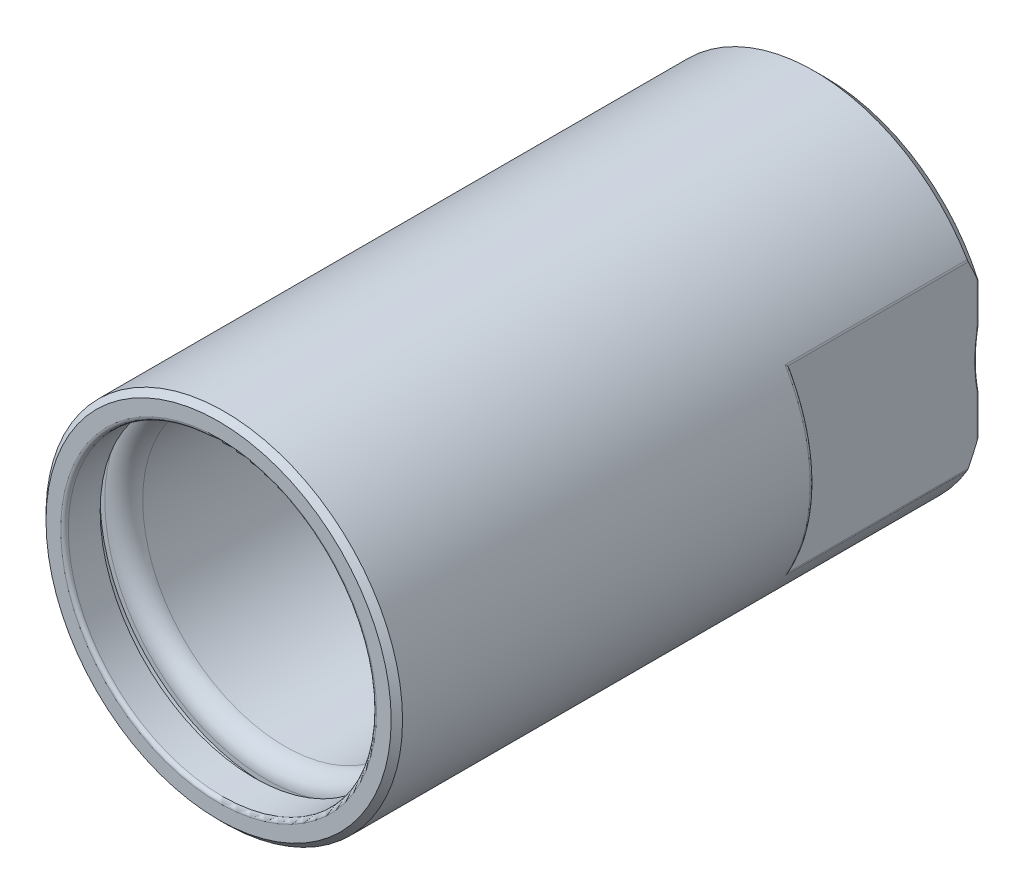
ISO-10303-21;
HEADER;
FILE_DESCRIPTION(('STEP AP214'),'2;1');
FILE_NAME('part.step','',(''),(''),'','','');
FILE_SCHEMA(('AUTOMOTIVE_DESIGN { 1 0 10303 214 1 1 1 1 }'));
ENDSEC;
DATA;
#1=APPLICATION_CONTEXT('core data for automotive mechanical design processes');
#2=APPLICATION_PROTOCOL_DEFINITION('international standard','automotive_design',2000,#1);
#3=PRODUCT_CONTEXT('',#1,'mechanical');
#4=PRODUCT('Part','Part','',(#3));
#5=PRODUCT_RELATED_PRODUCT_CATEGORY('part','',(#4));
#6=PRODUCT_DEFINITION_FORMATION('','',#4);
#7=PRODUCT_DEFINITION_CONTEXT('part definition',#1,'design');
#8=PRODUCT_DEFINITION('design','',#6,#7);
#9=PRODUCT_DEFINITION_SHAPE('','',#8);
#10=(LENGTH_UNIT() NAMED_UNIT(*) SI_UNIT(.MILLI.,.METRE.));
#11=(NAMED_UNIT(*) PLANE_ANGLE_UNIT() SI_UNIT($,.RADIAN.));
#12=(NAMED_UNIT(*) SI_UNIT($,.STERADIAN.) SOLID_ANGLE_UNIT());
#13=UNCERTAINTY_MEASURE_WITH_UNIT(LENGTH_MEASURE(1.E-05),#10,'distance_accuracy_value','');
#14=(GEOMETRIC_REPRESENTATION_CONTEXT(3) GLOBAL_UNCERTAINTY_ASSIGNED_CONTEXT((#13)) GLOBAL_UNIT_ASSIGNED_CONTEXT((#10,
#11,#12)) REPRESENTATION_CONTEXT('',''));
#15=CARTESIAN_POINT('',(0.,0.,0.));
#16=DIRECTION('',(0.,0.,1.));
#17=DIRECTION('',(1.,0.,0.));
#18=AXIS2_PLACEMENT_3D('',#15,#16,#17);
#19=CARTESIAN_POINT('',(0.,0.,0.));
#20=DIRECTION('',(0.,0.,1.));
#21=DIRECTION('',(1.,0.,0.));
#22=AXIS2_PLACEMENT_3D('',#19,#20,#21);
#23=PLANE('',#22);
#24=DIRECTION('',(0.,1.,0.));
#25=VECTOR('',#24,1.);
#26=CARTESIAN_POINT('',(-10.16,4.36813541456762,0.));
#27=LINE('',#26,#25);
#28=CARTESIAN_POINT('',(-10.16,1.91881059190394,0.));
#29=VERTEX_POINT('',#28);
#30=CARTESIAN_POINT('',(-10.16,4.52816890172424,0.));
#31=VERTEX_POINT('',#30);
#32=EDGE_CURVE('E508',#29,#31,#27,.T.);
#33=ORIENTED_EDGE('',*,*,#32,.T.);
#34=CARTESIAN_POINT('',(0.,0.,0.));
#35=DIRECTION('',(0.,0.,1.));
#36=DIRECTION('',(1.,0.,0.));
#37=AXIS2_PLACEMENT_3D('',#34,#35,#36);
#38=CIRCLE('',#37,11.1233948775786);
#39=CARTESIAN_POINT('',(10.16,4.52816890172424,0.));
#40=VERTEX_POINT('',#39);
#41=EDGE_CURVE('E510',#31,#40,#38,.F.);
#42=ORIENTED_EDGE('',*,*,#41,.T.);
#43=DIRECTION('',(0.,-1.,0.));
#44=VECTOR('',#43,1.);
#45=CARTESIAN_POINT('',(10.16,0.,0.));
#46=LINE('',#45,#44);
#47=CARTESIAN_POINT('',(10.16,1.91881059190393,0.));
#48=VERTEX_POINT('',#47);
#49=EDGE_CURVE('E504',#40,#48,#46,.T.);
#50=ORIENTED_EDGE('',*,*,#49,.T.);
#51=CARTESIAN_POINT('',(0.,0.,0.));
#52=DIRECTION('',(0.,0.,1.));
#53=DIRECTION('',(1.,0.,0.));
#54=AXIS2_PLACEMENT_3D('',#51,#52,#53);
#55=CIRCLE('',#54,10.3396051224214);
#56=EDGE_CURVE('E506',#48,#29,#55,.T.);
#57=ORIENTED_EDGE('',*,*,#56,.T.);
#58=EDGE_LOOP('',(#33,#42,#50,#57));
#59=FACE_BOUND('',#58,.T.);
#60=ADVANCED_FACE('F31',(#59),#23,.F.);
#61=DIRECTION('',(0.,1.,0.));
#62=VECTOR('',#61,1.);
#63=CARTESIAN_POINT('',(-10.16,0.,0.));
#64=LINE('',#63,#62);
#65=CARTESIAN_POINT('',(-10.16,-4.52816890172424,0.));
#66=VERTEX_POINT('',#65);
#67=CARTESIAN_POINT('',(-10.16,-1.91881059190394,0.));
#68=VERTEX_POINT('',#67);
#69=EDGE_CURVE('E597',#66,#68,#64,.T.);
#70=ORIENTED_EDGE('',*,*,#69,.T.);
#71=CARTESIAN_POINT('',(0.,0.,0.));
#72=DIRECTION('',(0.,0.,1.));
#73=DIRECTION('',(1.,0.,0.));
#74=AXIS2_PLACEMENT_3D('',#71,#72,#73);
#75=CIRCLE('',#74,10.3396051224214);
#76=CARTESIAN_POINT('',(10.16,-1.91881059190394,0.));
#77=VERTEX_POINT('',#76);
#78=EDGE_CURVE('E423',#68,#77,#75,.T.);
#79=ORIENTED_EDGE('',*,*,#78,.T.);
#80=DIRECTION('',(0.,-1.,0.));
#81=VECTOR('',#80,1.);
#82=CARTESIAN_POINT('',(10.16,-4.36813541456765,0.));
#83=LINE('',#82,#81);
#84=CARTESIAN_POINT('',(10.16,-4.52816890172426,0.));
#85=VERTEX_POINT('',#84);
#86=EDGE_CURVE('E946',#77,#85,#83,.T.);
#87=ORIENTED_EDGE('',*,*,#86,.T.);
#88=CARTESIAN_POINT('',(0.,0.,0.));
#89=DIRECTION('',(0.,0.,1.));
#90=DIRECTION('',(1.,0.,0.));
#91=AXIS2_PLACEMENT_3D('',#88,#89,#90);
#92=CIRCLE('',#91,11.1233948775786);
#93=EDGE_CURVE('E947',#85,#66,#92,.F.);
#94=ORIENTED_EDGE('',*,*,#93,.T.);
#95=EDGE_LOOP('',(#70,#79,#87,#94));
#96=FACE_BOUND('',#95,.T.);
#97=ADVANCED_FACE('F391',(#96),#23,.F.);
#98=CARTESIAN_POINT('',(0.,0.,0.));
#99=DIRECTION('',(0.,0.,1.));
#100=DIRECTION('',(1.,0.,0.));
#101=AXIS2_PLACEMENT_3D('',#98,#99,#100);
#102=CYLINDRICAL_SURFACE('',#101,9.525);
#103=CARTESIAN_POINT('',(0.,0.,36.195));
#104=DIRECTION('',(0.,0.,1.));
#105=DIRECTION('',(1.,0.,0.));
#106=AXIS2_PLACEMENT_3D('',#103,#104,#105);
#107=CIRCLE('',#106,9.525);
#108=CARTESIAN_POINT('',(9.52500000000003,0.,36.195));
#109=VERTEX_POINT('',#108);
#110=EDGE_CURVE('E11',#109,#109,#107,.T.);
#111=ORIENTED_EDGE('',*,*,#110,.T.);
#112=EDGE_LOOP('',(#111));
#113=FACE_BOUND('',#112,.T.);
#114=CARTESIAN_POINT('',(0.,0.,0.762000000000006));
#115=DIRECTION('',(0.,0.,1.));
#116=DIRECTION('',(1.,0.,0.));
#117=AXIS2_PLACEMENT_3D('',#114,#115,#116);
#118=CIRCLE('',#117,9.525);
#119=CARTESIAN_POINT('',(9.52500000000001,0.,0.762000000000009));
#120=VERTEX_POINT('',#119);
#121=EDGE_CURVE('E190',#120,#120,#118,.F.);
#122=ORIENTED_EDGE('',*,*,#121,.T.);
#123=EDGE_LOOP('',(#122));
#124=FACE_BOUND('',#123,.T.);
#125=ADVANCED_FACE('F397',(#113,#124),#102,.F.);
#126=CARTESIAN_POINT('',(0.,0.,40.64));
#127=DIRECTION('',(0.,0.,-1.));
#128=DIRECTION('',(-1.,0.,0.));
#129=AXIS2_PLACEMENT_3D('',#126,#127,#128);
#130=CYLINDRICAL_SURFACE('',#129,11.938);
#131=CARTESIAN_POINT('',(0.,0.,0.762000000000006));
#132=DIRECTION('',(0.,0.,1.));
#133=DIRECTION('',(1.,0.,0.));
#134=AXIS2_PLACEMENT_3D('',#131,#132,#133);
#135=CIRCLE('',#134,11.938);
#136=CARTESIAN_POINT('',(10.2511086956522,6.11805643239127,0.762000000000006));
#137=VERTEX_POINT('',#136);
#138=CARTESIAN_POINT('',(-10.2511086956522,6.11805643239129,0.762000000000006));
#139=VERTEX_POINT('',#138);
#140=EDGE_CURVE('E925',#137,#139,#135,.T.);
#141=ORIENTED_EDGE('',*,*,#140,.T.);
#142=DIRECTION('',(0.,0.,-1.));
#143=VECTOR('',#142,1.);
#144=CARTESIAN_POINT('',(-10.2511086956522,6.11805643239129,40.64));
#145=LINE('',#144,#143);
#146=CARTESIAN_POINT('',(-10.2511086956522,6.11805643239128,12.954));
#147=VERTEX_POINT('',#146);
#148=EDGE_CURVE('E958',#139,#147,#145,.F.);
#149=ORIENTED_EDGE('',*,*,#148,.T.);
#150=CARTESIAN_POINT('',(0.,0.,12.954));
#151=DIRECTION('',(0.,0.,-1.));
#152=DIRECTION('',(-1.,0.,0.));
#153=AXIS2_PLACEMENT_3D('',#150,#151,#152);
#154=CIRCLE('',#153,11.938);
#155=CARTESIAN_POINT('',(-10.2511086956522,-6.11805643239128,12.954));
#156=VERTEX_POINT('',#155);
#157=EDGE_CURVE('E962',#147,#156,#154,.F.);
#158=ORIENTED_EDGE('',*,*,#157,.T.);
#159=DIRECTION('',(0.,0.,-1.));
#160=VECTOR('',#159,1.);
#161=CARTESIAN_POINT('',(-10.2511086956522,-6.11805643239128,40.64));
#162=LINE('',#161,#160);
#163=CARTESIAN_POINT('',(-10.2511086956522,-6.11805643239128,0.762000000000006));
#164=VERTEX_POINT('',#163);
#165=EDGE_CURVE('E959',#156,#164,#162,.T.);
#166=ORIENTED_EDGE('',*,*,#165,.T.);
#167=CARTESIAN_POINT('',(0.,0.,0.762000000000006));
#168=DIRECTION('',(0.,0.,1.));
#169=DIRECTION('',(1.,0.,0.));
#170=AXIS2_PLACEMENT_3D('',#167,#168,#169);
#171=CIRCLE('',#170,11.938);
#172=CARTESIAN_POINT('',(10.2511086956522,-6.11805643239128,0.762000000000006));
#173=VERTEX_POINT('',#172);
#174=EDGE_CURVE('E198',#164,#173,#171,.T.);
#175=ORIENTED_EDGE('',*,*,#174,.T.);
#176=DIRECTION('',(0.,0.,-1.));
#177=VECTOR('',#176,1.);
#178=CARTESIAN_POINT('',(10.2511086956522,-6.11805643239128,40.64));
#179=LINE('',#178,#177);
#180=CARTESIAN_POINT('',(10.2511086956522,-6.11805643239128,12.954));
#181=VERTEX_POINT('',#180);
#182=EDGE_CURVE('E957',#173,#181,#179,.F.);
#183=ORIENTED_EDGE('',*,*,#182,.T.);
#184=CARTESIAN_POINT('',(0.,0.,12.954));
#185=DIRECTION('',(0.,0.,-1.));
#186=DIRECTION('',(-1.,0.,0.));
#187=AXIS2_PLACEMENT_3D('',#184,#185,#186);
#188=CIRCLE('',#187,11.938);
#189=CARTESIAN_POINT('',(10.2511086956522,6.11805643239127,12.954));
#190=VERTEX_POINT('',#189);
#191=EDGE_CURVE('E955',#181,#190,#188,.F.);
#192=ORIENTED_EDGE('',*,*,#191,.T.);
#193=DIRECTION('',(0.,0.,-1.));
#194=VECTOR('',#193,1.);
#195=CARTESIAN_POINT('',(10.2511086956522,6.11805643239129,40.64));
#196=LINE('',#195,#194);
#197=EDGE_CURVE('E953',#190,#137,#196,.T.);
#198=ORIENTED_EDGE('',*,*,#197,.T.);
#199=EDGE_LOOP('',(#141,#149,#158,#166,#175,#183,#192,#198));
#200=FACE_BOUND('',#199,.T.);
#201=CARTESIAN_POINT('',(0.,0.,40.259));
#202=DIRECTION('',(0.,0.,1.));
#203=DIRECTION('',(1.,0.,0.));
#204=AXIS2_PLACEMENT_3D('',#201,#202,#203);
#205=CIRCLE('',#204,11.938);
#206=CARTESIAN_POINT('',(11.938,0.,40.259));
#207=VERTEX_POINT('',#206);
#208=EDGE_CURVE('E209',#207,#207,#205,.F.);
#209=ORIENTED_EDGE('',*,*,#208,.T.);
#210=EDGE_LOOP('',(#209));
#211=FACE_BOUND('',#210,.T.);
#212=ADVANCED_FACE('F406',(#200,#211),#130,.T.);
#213=CARTESIAN_POINT('',(0.,0.,40.64));
#214=DIRECTION('',(0.,0.,1.));
#215=DIRECTION('',(1.,0.,0.));
#216=AXIS2_PLACEMENT_3D('',#213,#214,#215);
#217=PLANE('',#216);
#218=CARTESIAN_POINT('',(0.,0.,40.64));
#219=DIRECTION('',(0.,0.,1.));
#220=DIRECTION('',(1.,0.,0.));
#221=AXIS2_PLACEMENT_3D('',#218,#219,#220);
#222=CIRCLE('',#221,10.57275);
#223=CARTESIAN_POINT('',(10.57275,0.,40.64));
#224=VERTEX_POINT('',#223);
#225=EDGE_CURVE('E886',#224,#224,#222,.F.);
#226=ORIENTED_EDGE('',*,*,#225,.T.);
#227=EDGE_LOOP('',(#226));
#228=FACE_BOUND('',#227,.T.);
#229=CARTESIAN_POINT('',(0.,0.,40.64));
#230=DIRECTION('',(0.,0.,1.));
#231=DIRECTION('',(1.,0.,0.));
#232=AXIS2_PLACEMENT_3D('',#229,#230,#231);
#233=CIRCLE('',#232,11.557);
#234=CARTESIAN_POINT('',(11.557,0.,40.64));
#235=VERTEX_POINT('',#234);
#236=EDGE_CURVE('E215',#235,#235,#233,.T.);
#237=ORIENTED_EDGE('',*,*,#236,.T.);
#238=EDGE_LOOP('',(#237));
#239=FACE_BOUND('',#238,.T.);
#240=ADVANCED_FACE('F402',(#228,#239),#217,.T.);
#241=CARTESIAN_POINT('',(0.,0.,38.2524));
#242=DIRECTION('',(0.,0.,1.));
#243=DIRECTION('',(1.,0.,0.));
#244=AXIS2_PLACEMENT_3D('',#241,#242,#243);
#245=CYLINDRICAL_SURFACE('',#244,10.31875);
#246=CARTESIAN_POINT('',(0.,0.,40.386));
#247=DIRECTION('',(0.,0.,1.));
#248=DIRECTION('',(1.,0.,0.));
#249=AXIS2_PLACEMENT_3D('',#246,#247,#248);
#250=CIRCLE('',#249,10.31875);
#251=CARTESIAN_POINT('',(10.31875,0.,40.386));
#252=VERTEX_POINT('',#251);
#253=EDGE_CURVE('E894',#252,#252,#250,.T.);
#254=ORIENTED_EDGE('',*,*,#253,.T.);
#255=EDGE_LOOP('',(#254));
#256=FACE_BOUND('',#255,.T.);
#257=CARTESIAN_POINT('',(0.,0.,38.2524));
#258=DIRECTION('',(0.,0.,1.));
#259=DIRECTION('',(1.,0.,0.));
#260=AXIS2_PLACEMENT_3D('',#257,#258,#259);
#261=CIRCLE('',#260,10.31875);
#262=CARTESIAN_POINT('',(10.31875,0.,38.2524));
#263=VERTEX_POINT('',#262);
#264=EDGE_CURVE('E922',#263,#263,#261,.F.);
#265=ORIENTED_EDGE('',*,*,#264,.T.);
#266=EDGE_LOOP('',(#265));
#267=FACE_BOUND('',#266,.T.);
#268=ADVANCED_FACE('F405',(#256,#267),#245,.F.);
#269=CARTESIAN_POINT('',(0.,0.,37.465));
#270=DIRECTION('',(0.,0.,1.));
#271=DIRECTION('',(1.,0.,0.));
#272=AXIS2_PLACEMENT_3D('',#269,#270,#271);
#273=PLANE('',#272);
#274=CARTESIAN_POINT('',(0.,0.,37.465));
#275=DIRECTION('',(0.,0.,1.));
#276=DIRECTION('',(1.,0.,0.));
#277=AXIS2_PLACEMENT_3D('',#274,#275,#276);
#278=CIRCLE('',#277,10.795);
#279=CARTESIAN_POINT('',(10.795,0.,37.465));
#280=VERTEX_POINT('',#279);
#281=EDGE_CURVE('E40',#280,#280,#278,.F.);
#282=ORIENTED_EDGE('',*,*,#281,.T.);
#283=EDGE_LOOP('',(#282));
#284=FACE_BOUND('',#283,.T.);
#285=CARTESIAN_POINT('',(0.,0.,37.465));
#286=DIRECTION('',(0.,0.,1.));
#287=DIRECTION('',(1.,0.,0.));
#288=AXIS2_PLACEMENT_3D('',#285,#286,#287);
#289=CIRCLE('',#288,11.1125);
#290=CARTESIAN_POINT('',(11.1125,0.,37.465));
#291=VERTEX_POINT('',#290);
#292=EDGE_CURVE('E919',#291,#291,#289,.T.);
#293=ORIENTED_EDGE('',*,*,#292,.T.);
#294=EDGE_LOOP('',(#293));
#295=FACE_BOUND('',#294,.T.);
#296=ADVANCED_FACE('F375',(#284,#295),#273,.T.);
#297=CARTESIAN_POINT('',(0.,0.,38.2524));
#298=DIRECTION('',(0.,0.,1.));
#299=DIRECTION('',(1.,0.,0.));
#300=AXIS2_PLACEMENT_3D('',#297,#298,#299);
#301=PLANE('',#300);
#302=CARTESIAN_POINT('',(0.,0.,38.2524));
#303=DIRECTION('',(0.,0.,1.));
#304=DIRECTION('',(1.,0.,0.));
#305=AXIS2_PLACEMENT_3D('',#302,#303,#304);
#306=CIRCLE('',#305,11.1125);
#307=CARTESIAN_POINT('',(11.1125,0.,38.2524));
#308=VERTEX_POINT('',#307);
#309=EDGE_CURVE('E877',#308,#308,#306,.T.);
#310=ORIENTED_EDGE('',*,*,#309,.F.);
#311=EDGE_LOOP('',(#310));
#312=FACE_BOUND('',#311,.T.);
#313=ORIENTED_EDGE('',*,*,#264,.F.);
#314=EDGE_LOOP('',(#313));
#315=FACE_BOUND('',#314,.T.);
#316=ADVANCED_FACE('F809',(#312,#315),#301,.F.);
#317=CARTESIAN_POINT('',(0.,0.,37.465));
#318=DIRECTION('',(0.,0.,1.));
#319=DIRECTION('',(1.,0.,0.));
#320=AXIS2_PLACEMENT_3D('',#317,#318,#319);
#321=CYLINDRICAL_SURFACE('',#320,11.1125);
#322=ORIENTED_EDGE('',*,*,#292,.F.);
#323=EDGE_LOOP('',(#322));
#324=FACE_BOUND('',#323,.T.);
#325=ORIENTED_EDGE('',*,*,#309,.T.);
#326=EDGE_LOOP('',(#325));
#327=FACE_BOUND('',#326,.T.);
#328=ADVANCED_FACE('F803',(#324,#327),#321,.F.);
#329=CARTESIAN_POINT('',(-10.287,-6.05751392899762,12.7));
#330=DIRECTION('',(-1.,0.,0.));
#331=DIRECTION('',(0.,0.,1.));
#332=AXIS2_PLACEMENT_3D('',#329,#330,#331);
#333=PLANE('',#332);
#334=CARTESIAN_POINT('',(-10.0788258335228,4.76898114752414,-0.863152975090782));
#335=CARTESIAN_POINT('',(-10.1408877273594,4.74869782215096,-0.910576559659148));
#336=CARTESIAN_POINT('',(-10.2139438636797,4.76217699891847,-0.879061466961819));
#337=CARTESIAN_POINT('',(-10.287,4.77565617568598,-0.847546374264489));
#338=CARTESIAN_POINT('',(-10.287,4.80739019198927,-0.773350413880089));
#339=CARTESIAN_POINT('',(-10.077869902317,4.46107989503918,-0.730606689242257));
#340=CARTESIAN_POINT('',(-10.1397618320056,4.44078178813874,-0.778988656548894));
#341=CARTESIAN_POINT('',(-10.2133820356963,4.45415776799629,-0.747612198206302));
#342=CARTESIAN_POINT('',(-10.287,4.46640487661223,-0.715762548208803));
#343=CARTESIAN_POINT('',(-10.287,4.49746950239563,-0.640804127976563));
#344=CARTESIAN_POINT('',(-10.0769404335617,4.14927810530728,-0.606782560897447));
#345=CARTESIAN_POINT('',(-10.1386490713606,4.12975906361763,-0.656454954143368));
#346=CARTESIAN_POINT('',(-10.2128253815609,4.14233586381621,-0.6249171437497));
#347=CARTESIAN_POINT('',(-10.287,4.15393561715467,-0.593033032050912));
#348=CARTESIAN_POINT('',(-10.287,4.18350740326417,-0.516979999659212));
#349=CARTESIAN_POINT('',(-10.0751920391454,3.51734678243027,-0.380422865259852));
#350=CARTESIAN_POINT('',(-10.1365254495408,3.49963016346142,-0.4325144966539));
#351=CARTESIAN_POINT('',(-10.2117634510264,3.51060452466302,-0.400773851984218));
#352=CARTESIAN_POINT('',(-10.287,3.52068526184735,-0.368715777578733));
#353=CARTESIAN_POINT('',(-10.287,3.54698056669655,-0.290620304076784));
#354=CARTESIAN_POINT('',(-10.0743734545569,3.19719501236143,-0.277952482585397));
#355=CARTESIAN_POINT('',(-10.1355155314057,3.18057382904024,-0.331269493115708));
#356=CARTESIAN_POINT('',(-10.2112583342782,3.19067357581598,-0.299390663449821));
#357=CARTESIAN_POINT('',(-10.287,3.19995312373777,-0.26728993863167));
#358=CARTESIAN_POINT('',(-10.287,3.22439278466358,-0.188149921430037));
#359=CARTESIAN_POINT('',(-10.0729129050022,2.55077028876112,-0.0992348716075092));
#360=CARTESIAN_POINT('',(-10.1336900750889,2.53665096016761,-0.154727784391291));
#361=CARTESIAN_POINT('',(-10.210345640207,2.5449754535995,-0.122689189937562));
#362=CARTESIAN_POINT('',(-10.287,2.55246292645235,-0.0904189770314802));
#363=CARTESIAN_POINT('',(-10.287,2.57284724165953,-0.00943231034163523));
#364=CARTESIAN_POINT('',(-10.0722704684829,2.22451622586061,-0.0229174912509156));
#365=CARTESIAN_POINT('',(-10.1328749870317,2.21195367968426,-0.0794736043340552));
#366=CARTESIAN_POINT('',(-10.2099378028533,2.21922639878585,-0.0473011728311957));
#367=CARTESIAN_POINT('',(-10.287,2.22587508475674,-0.0150164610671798));
#368=CARTESIAN_POINT('',(-10.287,2.24390906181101,0.0668850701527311));
#369=CARTESIAN_POINT('',(-10.0712239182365,1.56702106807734,0.0996952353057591));
#370=CARTESIAN_POINT('',(-10.131535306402,1.55770946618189,0.0414670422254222));
#371=CARTESIAN_POINT('',(-10.2092679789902,1.56300289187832,0.0737594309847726));
#372=CARTESIAN_POINT('',(-10.287,1.56767589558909,0.106169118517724));
#373=CARTESIAN_POINT('',(-10.287,1.58085124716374,0.189497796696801));
#374=CARTESIAN_POINT('',(-10.0708194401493,1.23578839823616,0.146036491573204));
#375=CARTESIAN_POINT('',(-10.1310113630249,1.22842674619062,0.0870936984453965));
#376=CARTESIAN_POINT('',(-10.2090057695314,1.23253646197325,0.119477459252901));
#377=CARTESIAN_POINT('',(-10.287,1.23633030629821,0.151892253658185));
#378=CARTESIAN_POINT('',(-10.287,1.24674034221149,0.23583905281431));
#379=CARTESIAN_POINT('',(-10.070437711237,0.753036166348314,0.189560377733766));
#380=CARTESIAN_POINT('',(-10.1305150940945,0.748552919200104,0.129965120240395));
#381=CARTESIAN_POINT('',(-10.2087575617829,0.751007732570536,0.162407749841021));
#382=CARTESIAN_POINT('',(-10.287,0.753393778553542,0.194855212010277));
#383=CARTESIAN_POINT('',(-10.287,0.759735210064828,0.279362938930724));
#384=CARTESIAN_POINT('',(-10.0703478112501,0.602560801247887,0.199764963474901));
#385=CARTESIAN_POINT('',(-10.1303978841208,0.598972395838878,0.140016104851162));
#386=CARTESIAN_POINT('',(-10.2086989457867,0.600928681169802,0.172471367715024));
#387=CARTESIAN_POINT('',(-10.287,0.602850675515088,0.204927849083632));
#388=CARTESIAN_POINT('',(-10.287,0.607926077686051,0.289567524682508));
#389=CARTESIAN_POINT('',(-10.0702276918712,0.301390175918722,0.213384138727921));
#390=CARTESIAN_POINT('',(-10.1302411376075,0.299578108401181,0.153432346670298));
#391=CARTESIAN_POINT('',(-10.2086205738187,0.300566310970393,0.185901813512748));
#392=CARTESIAN_POINT('',(-10.287,0.30152180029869,0.218373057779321));
#393=CARTESIAN_POINT('',(-10.287,0.304077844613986,0.30318669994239));
#394=CARTESIAN_POINT('',(-10.0701974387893,0.150695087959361,0.216802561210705));
#395=CARTESIAN_POINT('',(-10.1302015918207,0.149797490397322,0.156798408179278));
#396=CARTESIAN_POINT('',(-10.2086007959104,0.150283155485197,0.189272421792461));
#397=CARTESIAN_POINT('',(-10.287,0.150769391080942,0.221746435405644));
#398=CARTESIAN_POINT('',(-10.287,0.152038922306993,0.306605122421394));
#399=CARTESIAN_POINT('',(-10.0701974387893,-0.150695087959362,0.216802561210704));
#400=CARTESIAN_POINT('',(-10.1302015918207,-0.149797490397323,0.156798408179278));
#401=CARTESIAN_POINT('',(-10.2086007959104,-0.150283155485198,0.18927242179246));
#402=CARTESIAN_POINT('',(-10.287,-0.150769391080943,0.221746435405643));
#403=CARTESIAN_POINT('',(-10.287,-0.152038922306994,0.306605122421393));
#404=CARTESIAN_POINT('',(-10.0702276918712,-0.301390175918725,0.213384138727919));
#405=CARTESIAN_POINT('',(-10.1302411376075,-0.299578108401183,0.153432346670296));
#406=CARTESIAN_POINT('',(-10.2086205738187,-0.300566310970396,0.185901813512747));
#407=CARTESIAN_POINT('',(-10.287,-0.301521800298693,0.218373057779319));
#408=CARTESIAN_POINT('',(-10.287,-0.304077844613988,0.303186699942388));
#409=CARTESIAN_POINT('',(-10.0703478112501,-0.602560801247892,0.1997649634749));
#410=CARTESIAN_POINT('',(-10.1303978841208,-0.598972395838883,0.140016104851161));
#411=CARTESIAN_POINT('',(-10.2086989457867,-0.600928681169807,0.172471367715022));
#412=CARTESIAN_POINT('',(-10.287,-0.602850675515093,0.204927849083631));
#413=CARTESIAN_POINT('',(-10.287,-0.607926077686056,0.289567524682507));
#414=CARTESIAN_POINT('',(-10.070437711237,-0.75303616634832,0.189560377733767));
#415=CARTESIAN_POINT('',(-10.1305150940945,-0.74855291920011,0.129965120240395));
#416=CARTESIAN_POINT('',(-10.2087575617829,-0.751007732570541,0.16240774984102));
#417=CARTESIAN_POINT('',(-10.287,-0.753393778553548,0.194855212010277));
#418=CARTESIAN_POINT('',(-10.287,-0.759735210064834,0.279362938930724));
#419=CARTESIAN_POINT('',(-10.0708194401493,-1.23578839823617,0.146036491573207));
#420=CARTESIAN_POINT('',(-10.1310113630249,-1.22842674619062,0.0870936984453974));
#421=CARTESIAN_POINT('',(-10.2090057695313,-1.23253646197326,0.119477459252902));
#422=CARTESIAN_POINT('',(-10.287,-1.23633030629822,0.151892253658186));
#423=CARTESIAN_POINT('',(-10.287,-1.24674034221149,0.235839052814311));
#424=CARTESIAN_POINT('',(-10.0712239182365,-1.56702106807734,0.0996952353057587));
#425=CARTESIAN_POINT('',(-10.131535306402,-1.55770946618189,0.0414670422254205));
#426=CARTESIAN_POINT('',(-10.2092679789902,-1.56300289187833,0.0737594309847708));
#427=CARTESIAN_POINT('',(-10.287,-1.56767589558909,0.106169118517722));
#428=CARTESIAN_POINT('',(-10.287,-1.58085124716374,0.189497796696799));
#429=CARTESIAN_POINT('',(-10.0722704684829,-2.22451622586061,-0.0229174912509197));
#430=CARTESIAN_POINT('',(-10.1328749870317,-2.21195367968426,-0.0794736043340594));
#431=CARTESIAN_POINT('',(-10.2099378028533,-2.21922639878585,-0.0473011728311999));
#432=CARTESIAN_POINT('',(-10.287,-2.22587508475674,-0.0150164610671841));
#433=CARTESIAN_POINT('',(-10.287,-2.24390906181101,0.0668850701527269));
#434=CARTESIAN_POINT('',(-10.0729129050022,-2.55077028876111,-0.0992348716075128));
#435=CARTESIAN_POINT('',(-10.1336900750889,-2.53665096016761,-0.154727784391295));
#436=CARTESIAN_POINT('',(-10.210345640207,-2.54497545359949,-0.122689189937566));
#437=CARTESIAN_POINT('',(-10.287,-2.55246292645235,-0.090418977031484));
#438=CARTESIAN_POINT('',(-10.287,-2.57284724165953,-0.00943231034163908));
#439=CARTESIAN_POINT('',(-10.0743734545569,-3.19719501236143,-0.2779524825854));
#440=CARTESIAN_POINT('',(-10.1355155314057,-3.18057382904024,-0.331269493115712));
#441=CARTESIAN_POINT('',(-10.2112583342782,-3.19067357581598,-0.299390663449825));
#442=CARTESIAN_POINT('',(-10.287,-3.19995312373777,-0.267289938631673));
#443=CARTESIAN_POINT('',(-10.287,-3.22439278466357,-0.18814992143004));
#444=CARTESIAN_POINT('',(-10.0751920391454,-3.51734678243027,-0.380422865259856));
#445=CARTESIAN_POINT('',(-10.1365254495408,-3.49963016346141,-0.432514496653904));
#446=CARTESIAN_POINT('',(-10.2117634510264,-3.51060452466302,-0.400773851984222));
#447=CARTESIAN_POINT('',(-10.287,-3.52068526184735,-0.368715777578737));
#448=CARTESIAN_POINT('',(-10.287,-3.54698056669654,-0.290620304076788));
#449=CARTESIAN_POINT('',(-10.0769404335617,-4.14927810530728,-0.606782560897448));
#450=CARTESIAN_POINT('',(-10.1386490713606,-4.12975906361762,-0.656454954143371));
#451=CARTESIAN_POINT('',(-10.2128253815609,-4.1423358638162,-0.624917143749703));
#452=CARTESIAN_POINT('',(-10.287,-4.15393561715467,-0.593033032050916));
#453=CARTESIAN_POINT('',(-10.287,-4.18350740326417,-0.516979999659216));
#454=CARTESIAN_POINT('',(-10.077869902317,-4.46107989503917,-0.730606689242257));
#455=CARTESIAN_POINT('',(-10.1397618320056,-4.44078178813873,-0.778988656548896));
#456=CARTESIAN_POINT('',(-10.2133820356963,-4.45415776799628,-0.747612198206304));
#457=CARTESIAN_POINT('',(-10.287,-4.46640487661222,-0.715762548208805));
#458=CARTESIAN_POINT('',(-10.287,-4.49746950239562,-0.640804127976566));
#459=CARTESIAN_POINT('',(-10.0788258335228,-4.76898114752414,-0.863152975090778));
#460=CARTESIAN_POINT('',(-10.1408877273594,-4.74869782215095,-0.910576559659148));
#461=CARTESIAN_POINT('',(-10.2139438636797,-4.76217699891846,-0.879061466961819));
#462=CARTESIAN_POINT('',(-10.287,-4.77565617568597,-0.847546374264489));
#463=CARTESIAN_POINT('',(-10.287,-4.80739019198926,-0.773350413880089));
#464=(BOUNDED_SURFACE() B_SPLINE_SURFACE(3,2,((#334,#335,#336,#337,#338),(#339,#340,#341,#342,
#343),(#344,#345,#346,#347,#348),(#349,#350,#351,#352,#353),(#354,#355,#356,#357,#358),(#359,
#360,#361,#362,#363),(#364,#365,#366,#367,#368),(#369,#370,#371,#372,#373),(#374,#375,#376,#377,
#378),(#379,#380,#381,#382,#383),(#384,#385,#386,#387,#388),(#389,#390,#391,#392,#393),(#394,
#395,#396,#397,#398),(#399,#400,#401,#402,#403),(#404,#405,#406,#407,#408),(#409,#410,#411,#412,
#413),(#414,#415,#416,#417,#418),(#419,#420,#421,#422,#423),(#424,#425,#426,#427,#428),(#429,
#430,#431,#432,#433),(#434,#435,#436,#437,#438),(#439,#440,#441,#442,#443),(#444,#445,#446,#447,
#448),(#449,#450,#451,#452,#453),(#454,#455,#456,#457,#458),(#459,#460,#461,#462,#463)),
.UNSPECIFIED.,.F.,.F.,.F.) B_SPLINE_SURFACE_WITH_KNOTS((4,2,2,2,2,2,2,2,2,2,2,2,4),(3,2,3),(0.,
1.01152383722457,2.02609163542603,3.03791628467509,4.04818757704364,4.50451908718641,
4.9605927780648,5.4166664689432,5.87299797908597,6.88326927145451,7.89509392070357,
8.90966171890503,9.9211855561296),(0.,0.5,1.),
.UNSPECIFIED.) GEOMETRIC_REPRESENTATION_ITEM() RATIONAL_B_SPLINE_SURFACE(((1.,0.844024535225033,
1.,0.844024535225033,1.),(1.,0.842714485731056,1.,0.842714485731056,1.),(1.,0.841412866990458,
1.,0.841412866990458,1.),(1.,0.838924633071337,1.,0.838924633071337,1.),(1.,0.837738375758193,
1.,0.837738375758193,1.),(1.,0.835591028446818,1.,0.835591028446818,1.),(1.,0.834629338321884,
1.,0.834629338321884,1.),(1.,0.833048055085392,1.,0.833048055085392,1.),(1.,0.832427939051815,
1.,0.832427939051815,1.),(1.,0.831840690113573,1.,0.831840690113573,1.),(1.,0.831701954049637,
1.,0.831701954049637,1.),(1.,0.831516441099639,1.,0.831516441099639,1.),(1.,0.831469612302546,
1.,0.831469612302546,1.),(1.,0.831469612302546,1.,0.831469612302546,1.),(1.,0.831516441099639,
1.,0.831516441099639,1.),(1.,0.831701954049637,1.,0.831701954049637,1.),(1.,0.831840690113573,
1.,0.831840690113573,1.),(1.,0.832427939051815,1.,0.832427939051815,1.),(1.,0.833048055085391,
1.,0.833048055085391,1.),(1.,0.834629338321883,1.,0.834629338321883,1.),(1.,0.835591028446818,
1.,0.835591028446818,1.),(1.,0.837738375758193,1.,0.837738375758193,1.),(1.,0.838924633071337,
1.,0.838924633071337,1.),(1.,0.841412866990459,1.,0.841412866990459,1.),(1.,0.842714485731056,
1.,0.842714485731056,1.),(1.,0.844024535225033,1.,0.844024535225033,1.))) REPRESENTATION_ITEM('') SURFACE());
#465=CARTESIAN_POINT('',(-10.287,-4.80739019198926,-0.773350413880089));
#466=CARTESIAN_POINT('',(-10.287,-4.49746950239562,-0.640804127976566));
#467=CARTESIAN_POINT('',(-10.287,-4.18350740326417,-0.516979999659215));
#468=CARTESIAN_POINT('',(-10.287,-3.54698056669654,-0.290620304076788));
#469=CARTESIAN_POINT('',(-10.287,-3.22439278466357,-0.18814992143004));
#470=CARTESIAN_POINT('',(-10.287,-2.57284724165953,-0.00943231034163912));
#471=CARTESIAN_POINT('',(-10.287,-2.24390906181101,0.0668850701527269));
#472=CARTESIAN_POINT('',(-10.287,-1.58085124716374,0.189497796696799));
#473=CARTESIAN_POINT('',(-10.287,-1.24674034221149,0.235839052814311));
#474=CARTESIAN_POINT('',(-10.287,-0.759735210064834,0.279362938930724));
#475=CARTESIAN_POINT('',(-10.287,-0.607926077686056,0.289567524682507));
#476=CARTESIAN_POINT('',(-10.287,-0.304077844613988,0.303186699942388));
#477=CARTESIAN_POINT('',(-10.287,-0.152038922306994,0.306605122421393));
#478=CARTESIAN_POINT('',(-10.287,0.152038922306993,0.306605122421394));
#479=CARTESIAN_POINT('',(-10.287,0.304077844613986,0.30318669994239));
#480=CARTESIAN_POINT('',(-10.287,0.607926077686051,0.289567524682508));
#481=CARTESIAN_POINT('',(-10.287,0.759735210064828,0.279362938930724));
#482=CARTESIAN_POINT('',(-10.287,1.24674034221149,0.23583905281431));
#483=CARTESIAN_POINT('',(-10.287,1.58085124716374,0.189497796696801));
#484=CARTESIAN_POINT('',(-10.287,2.24390906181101,0.0668850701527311));
#485=CARTESIAN_POINT('',(-10.287,2.57284724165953,-0.00943231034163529));
#486=CARTESIAN_POINT('',(-10.287,3.22439278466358,-0.188149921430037));
#487=CARTESIAN_POINT('',(-10.287,3.54698056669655,-0.290620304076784));
#488=CARTESIAN_POINT('',(-10.287,4.18350740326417,-0.516979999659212));
#489=CARTESIAN_POINT('',(-10.287,4.49746950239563,-0.640804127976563));
#490=CARTESIAN_POINT('',(-10.287,4.80739019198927,-0.773350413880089));
#491=B_SPLINE_CURVE_WITH_KNOTS('',3,(#465,#466,#467,#468,#469,#470,#471,#472,#473,#474,#475,
#476,#477,#478,#479,#480,#481,#482,#483,#484,#485,#486,#487,#488,#489,#490),.UNSPECIFIED.,.F.,
.F.,(4,2,2,2,2,2,2,2,2,2,2,2,4),(0.,1.01152383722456,2.02609163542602,3.03791628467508,
4.04818757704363,4.5045190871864,4.96059277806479,5.41666646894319,5.87299797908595,
6.8832692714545,7.89509392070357,8.90966171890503,9.9211855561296),.UNSPECIFIED.);
#492=CARTESIAN_POINT('',(-10.287,-1.91881059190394,0.127000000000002));
#493=VERTEX_POINT('',#492);
#494=CARTESIAN_POINT('',(-10.287,1.91881059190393,0.127000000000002));
#495=VERTEX_POINT('',#494);
#496=EDGE_CURVE('E434',#493,#495,#491,.T.);
#497=ORIENTED_EDGE('',*,*,#496,.F.);
#498=DIRECTION('',(0.,1.,0.));
#499=VECTOR('',#498,1.);
#500=CARTESIAN_POINT('',(-10.287,-4.36813541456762,0.127000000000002));
#501=LINE('',#500,#499);
#502=CARTESIAN_POINT('',(-10.287,-4.68352858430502,0.127000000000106));
#503=VERTEX_POINT('',#502);
#504=EDGE_CURVE('E188',#493,#503,#501,.F.);
#505=ORIENTED_EDGE('',*,*,#504,.T.);
#506=CARTESIAN_POINT('',(-10.287,-4.36813541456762,0.));
#507=CARTESIAN_POINT('',(-10.287,-4.5120860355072,0.0562659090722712));
#508=CARTESIAN_POINT('',(-10.287,-4.65523110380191,0.114567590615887));
#509=CARTESIAN_POINT('',(-10.287,-4.93986102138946,0.234870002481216));
#510=CARTESIAN_POINT('',(-10.287,-5.08134679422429,0.296868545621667));
#511=CARTESIAN_POINT('',(-10.287,-5.3627687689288,0.424254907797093));
#512=CARTESIAN_POINT('',(-10.287,-5.50270506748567,0.489642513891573));
#513=CARTESIAN_POINT('',(-10.287,-5.78117205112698,0.623552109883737));
#514=CARTESIAN_POINT('',(-10.287,-5.91970186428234,0.692075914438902));
#515=CARTESIAN_POINT('',(-10.287,-6.05751392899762,0.762000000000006));
#516=B_SPLINE_CURVE_WITH_KNOTS('',3,(#506,#507,#508,#509,#510,#511,#512,#513,#514,#515),
.UNSPECIFIED.,.F.,.F.,(4,2,2,2,4),(0.,0.463640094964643,0.927008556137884,1.39034793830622,
1.85395889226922),.UNSPECIFIED.);
#517=CARTESIAN_POINT('',(-10.287,-5.9878850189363,0.726820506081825));
#518=VERTEX_POINT('',#517);
#519=EDGE_CURVE('E181',#503,#518,#516,.T.);
#520=ORIENTED_EDGE('',*,*,#519,.T.);
#521=DIRECTION('',(0.,0.,1.));
#522=VECTOR('',#521,1.);
#523=CARTESIAN_POINT('',(-10.287,-5.98788501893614,12.7));
#524=LINE('',#523,#522);
#525=CARTESIAN_POINT('',(-10.287,-5.98788501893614,12.8250287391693));
#526=VERTEX_POINT('',#525);
#527=EDGE_CURVE('E185',#518,#526,#524,.T.);
#528=ORIENTED_EDGE('',*,*,#527,.T.);
#529=CARTESIAN_POINT('',(-10.287,-5.98788501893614,12.8250287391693));
#530=CARTESIAN_POINT('',(-10.287,-5.97961361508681,12.8179805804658));
#531=CARTESIAN_POINT('',(-10.287,-5.97098028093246,12.8113888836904));
#532=CARTESIAN_POINT('',(-10.287,-5.95317225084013,12.7990308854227));
#533=CARTESIAN_POINT('',(-10.287,-5.94399903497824,12.793262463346));
#534=CARTESIAN_POINT('',(-10.287,-5.91604186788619,12.7771074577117));
#535=CARTESIAN_POINT('',(-10.287,-5.89666644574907,12.7677487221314));
#536=CARTESIAN_POINT('',(-10.287,-5.85835894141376,12.7517926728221));
#537=CARTESIAN_POINT('',(-10.287,-5.83948392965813,12.7450524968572));
#538=CARTESIAN_POINT('',(-10.287,-5.80122849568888,12.7331809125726));
#539=CARTESIAN_POINT('',(-10.287,-5.78184772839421,12.7280506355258));
#540=CARTESIAN_POINT('',(-10.287,-5.72296162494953,12.7146837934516));
#541=CARTESIAN_POINT('',(-10.287,-5.6829644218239,12.7085675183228));
#542=CARTESIAN_POINT('',(-10.287,-5.62566184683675,12.7031545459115));
#543=CARTESIAN_POINT('',(-10.287,-5.60849513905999,12.7019584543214));
#544=CARTESIAN_POINT('',(-10.287,-5.57427774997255,12.7003854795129));
#545=CARTESIAN_POINT('',(-10.287,-5.55722740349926,12.7000013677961));
#546=CARTESIAN_POINT('',(-10.287,-5.54017030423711,12.7));
#547=B_SPLINE_CURVE_WITH_KNOTS('',3,(#529,#530,#531,#532,#533,#534,#535,#536,#537,#538,#539,
#540,#541,#542,#543,#544,#545,#546),.UNSPECIFIED.,.F.,.F.,(4,2,2,2,2,2,2,2,4),(0.,
0.0325546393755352,0.0650238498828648,0.129379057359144,0.189428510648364,0.249520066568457,
0.370504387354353,0.422118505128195,0.473271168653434),.UNSPECIFIED.);
#548=CARTESIAN_POINT('',(-10.287,-5.54017030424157,12.7));
#549=VERTEX_POINT('',#548);
#550=EDGE_CURVE('E287',#526,#549,#547,.T.);
#551=ORIENTED_EDGE('',*,*,#550,.T.);
#552=DIRECTION('',(0.,1.,0.));
#553=VECTOR('',#552,1.);
#554=CARTESIAN_POINT('',(-10.287,-6.05751392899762,12.7));
#555=LINE('',#554,#553);
#556=CARTESIAN_POINT('',(-10.287,5.54017030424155,12.7));
#557=VERTEX_POINT('',#556);
#558=EDGE_CURVE('E878',#549,#557,#555,.T.);
#559=ORIENTED_EDGE('',*,*,#558,.T.);
#560=CARTESIAN_POINT('',(-10.287,5.54017030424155,12.7));
#561=CARTESIAN_POINT('',(-10.287,5.56802229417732,12.7000229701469));
#562=CARTESIAN_POINT('',(-10.287,5.59589359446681,12.7010325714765));
#563=CARTESIAN_POINT('',(-10.287,5.6516119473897,12.705262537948));
#564=CARTESIAN_POINT('',(-10.287,5.67945810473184,12.7084944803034));
#565=CARTESIAN_POINT('',(-10.287,5.73358551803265,12.7172208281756));
#566=CARTESIAN_POINT('',(-10.287,5.75988281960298,12.722612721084));
#567=CARTESIAN_POINT('',(-10.287,5.81176222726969,12.7360200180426));
#568=CARTESIAN_POINT('',(-10.287,5.83734564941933,12.7440301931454));
#569=CARTESIAN_POINT('',(-10.287,5.88466308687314,12.7622899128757));
#570=CARTESIAN_POINT('',(-10.287,5.906517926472,12.7722126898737));
#571=CARTESIAN_POINT('',(-10.287,5.93813164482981,12.7896979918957));
#572=CARTESIAN_POINT('',(-10.287,5.94856508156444,12.7960305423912));
#573=CARTESIAN_POINT('',(-10.287,5.96877971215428,12.8097234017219));
#574=CARTESIAN_POINT('',(-10.287,5.97855863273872,12.8170870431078));
#575=CARTESIAN_POINT('',(-10.287,5.98788501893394,12.825028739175));
#576=B_SPLINE_CURVE_WITH_KNOTS('',3,(#560,#561,#562,#563,#564,#565,#566,#567,#568,#569,#570,
#571,#572,#573,#574,#575),.UNSPECIFIED.,.F.,.F.,(4,2,2,2,2,2,2,4),(0.,0.0835686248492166,
0.167575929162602,0.247995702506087,0.328255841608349,0.400020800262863,0.436581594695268,
0.473263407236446),.UNSPECIFIED.);
#577=CARTESIAN_POINT('',(-10.287,5.98788501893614,12.8250287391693));
#578=VERTEX_POINT('',#577);
#579=EDGE_CURVE('E882',#557,#578,#576,.T.);
#580=ORIENTED_EDGE('',*,*,#579,.T.);
#581=DIRECTION('',(0.,0.,1.));
#582=VECTOR('',#581,1.);
#583=CARTESIAN_POINT('',(-10.287,5.98788501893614,0.762000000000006));
#584=LINE('',#583,#582);
#585=CARTESIAN_POINT('',(-10.287,5.98788501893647,0.726820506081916));
#586=VERTEX_POINT('',#585);
#587=EDGE_CURVE('E208',#578,#586,#584,.F.);
#588=ORIENTED_EDGE('',*,*,#587,.T.);
#589=CARTESIAN_POINT('',(-10.287,6.05751392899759,0.762000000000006));
#590=CARTESIAN_POINT('',(-10.287,5.91970186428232,0.692075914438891));
#591=CARTESIAN_POINT('',(-10.287,5.78117205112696,0.623552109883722));
#592=CARTESIAN_POINT('',(-10.287,5.50270506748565,0.489642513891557));
#593=CARTESIAN_POINT('',(-10.287,5.36276876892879,0.424254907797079));
#594=CARTESIAN_POINT('',(-10.287,5.08134679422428,0.296868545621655));
#595=CARTESIAN_POINT('',(-10.287,4.93986102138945,0.234870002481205));
#596=CARTESIAN_POINT('',(-10.287,4.6552311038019,0.114567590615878));
#597=CARTESIAN_POINT('',(-10.287,4.51208603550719,0.0562659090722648));
#598=CARTESIAN_POINT('',(-10.287,4.36813541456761,0.));
#599=B_SPLINE_CURVE_WITH_KNOTS('',3,(#589,#590,#591,#592,#593,#594,#595,#596,#597,#598),
.UNSPECIFIED.,.F.,.F.,(4,2,2,2,4),(0.,0.463610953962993,0.926950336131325,1.39031879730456,
1.8539588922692),.UNSPECIFIED.);
#600=CARTESIAN_POINT('',(-10.287,4.68352858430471,0.126999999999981));
#601=VERTEX_POINT('',#600);
#602=EDGE_CURVE('E191',#586,#601,#599,.T.);
#603=ORIENTED_EDGE('',*,*,#602,.T.);
#604=DIRECTION('',(0.,1.,0.));
#605=VECTOR('',#604,1.);
#606=CARTESIAN_POINT('',(-10.287,0.,0.127000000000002));
#607=LINE('',#606,#605);
#608=EDGE_CURVE('E440',#601,#495,#607,.F.);
#609=ORIENTED_EDGE('',*,*,#608,.T.);
#610=EDGE_LOOP('',(#497,#505,#520,#528,#551,#559,#580,#588,#603,#609));
#611=FACE_BOUND('',#610,.T.);
#612=ADVANCED_FACE('F183',(#611),#333,.T.);
#613=CARTESIAN_POINT('',(0.,0.,12.7));
#614=DIRECTION('',(0.,0.,-1.));
#615=DIRECTION('',(-1.,0.,0.));
#616=AXIS2_PLACEMENT_3D('',#613,#614,#615);
#617=PLANE('',#616);
#618=ORIENTED_EDGE('',*,*,#558,.F.);
#619=CARTESIAN_POINT('',(0.,0.,12.7));
#620=DIRECTION('',(0.,0.,-1.));
#621=DIRECTION('',(-1.,0.,0.));
#622=AXIS2_PLACEMENT_3D('',#619,#620,#621);
#623=CIRCLE('',#622,11.684);
#624=EDGE_CURVE('E883',#549,#557,#623,.T.);
#625=ORIENTED_EDGE('',*,*,#624,.T.);
#626=EDGE_LOOP('',(#618,#625));
#627=FACE_BOUND('',#626,.T.);
#628=ADVANCED_FACE('F735',(#627),#617,.T.);
#629=DIRECTION('',(0.,-1.,0.));
#630=VECTOR('',#629,1.);
#631=CARTESIAN_POINT('',(10.287,-6.05751392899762,12.7));
#632=LINE('',#631,#630);
#633=CARTESIAN_POINT('',(10.287,5.54017030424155,12.7));
#634=VERTEX_POINT('',#633);
#635=CARTESIAN_POINT('',(10.287,-5.54017030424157,12.7));
#636=VERTEX_POINT('',#635);
#637=EDGE_CURVE('E873',#634,#636,#632,.T.);
#638=ORIENTED_EDGE('',*,*,#637,.F.);
#639=CARTESIAN_POINT('',(0.,0.,12.7));
#640=DIRECTION('',(0.,0.,-1.));
#641=DIRECTION('',(-1.,0.,0.));
#642=AXIS2_PLACEMENT_3D('',#639,#640,#641);
#643=CIRCLE('',#642,11.684);
#644=EDGE_CURVE('E875',#634,#636,#643,.T.);
#645=ORIENTED_EDGE('',*,*,#644,.T.);
#646=EDGE_LOOP('',(#638,#645));
#647=FACE_BOUND('',#646,.T.);
#648=ADVANCED_FACE('F301',(#647),#617,.T.);
#649=CARTESIAN_POINT('',(10.287,-6.05751392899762,12.7));
#650=DIRECTION('',(1.,0.,0.));
#651=DIRECTION('',(0.,0.,-1.));
#652=AXIS2_PLACEMENT_3D('',#649,#650,#651);
#653=PLANE('',#652);
#654=CARTESIAN_POINT('',(10.287,-6.05751392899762,0.762000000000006));
#655=CARTESIAN_POINT('',(10.287,-5.91970186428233,0.692075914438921));
#656=CARTESIAN_POINT('',(10.287,-5.78117205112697,0.623552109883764));
#657=CARTESIAN_POINT('',(10.287,-5.50270506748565,0.489642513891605));
#658=CARTESIAN_POINT('',(10.287,-5.36276876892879,0.424254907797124));
#659=CARTESIAN_POINT('',(10.287,-5.08134679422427,0.2968685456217));
#660=CARTESIAN_POINT('',(10.287,-4.93986102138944,0.234870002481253));
#661=CARTESIAN_POINT('',(10.287,-4.65523110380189,0.114567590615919));
#662=CARTESIAN_POINT('',(10.287,-4.51208603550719,0.056265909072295));
#663=CARTESIAN_POINT('',(10.287,-4.36813541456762,0.));
#664=B_SPLINE_CURVE_WITH_KNOTS('',3,(#654,#655,#656,#657,#658,#659,#660,#661,#662,#663),
.UNSPECIFIED.,.F.,.F.,(4,2,2,2,4),(0.,0.463610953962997,0.926950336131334,1.39031879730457,
1.85395889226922),.UNSPECIFIED.);
#665=CARTESIAN_POINT('',(10.287,-5.98788501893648,0.726820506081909));
#666=VERTEX_POINT('',#665);
#667=CARTESIAN_POINT('',(10.287,-4.68352858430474,0.126999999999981));
#668=VERTEX_POINT('',#667);
#669=EDGE_CURVE('E318',#666,#668,#664,.T.);
#670=ORIENTED_EDGE('',*,*,#669,.T.);
#671=DIRECTION('',(0.,-1.,0.));
#672=VECTOR('',#671,1.);
#673=CARTESIAN_POINT('',(10.287,0.,0.127000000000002));
#674=LINE('',#673,#672);
#675=CARTESIAN_POINT('',(10.287,-1.91881059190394,0.127000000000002));
#676=VERTEX_POINT('',#675);
#677=EDGE_CURVE('E502',#668,#676,#674,.F.);
#678=ORIENTED_EDGE('',*,*,#677,.T.);
#679=CARTESIAN_POINT('',(10.287,4.80739019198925,-0.773350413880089));
#680=CARTESIAN_POINT('',(10.287,4.77565617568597,-0.847546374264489));
#681=CARTESIAN_POINT('',(10.2139438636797,4.76217699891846,-0.879061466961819));
#682=CARTESIAN_POINT('',(10.1408877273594,4.74869782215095,-0.910576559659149));
#683=CARTESIAN_POINT('',(10.0788258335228,4.76898114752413,-0.863152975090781));
#684=CARTESIAN_POINT('',(10.287,4.49746950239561,-0.64080412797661));
#685=CARTESIAN_POINT('',(10.287,4.46640487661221,-0.715762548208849));
#686=CARTESIAN_POINT('',(10.2133820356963,4.45415776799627,-0.747612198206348));
#687=CARTESIAN_POINT('',(10.1397618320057,4.44078178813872,-0.778988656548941));
#688=CARTESIAN_POINT('',(10.077869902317,4.46107989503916,-0.730606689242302));
#689=CARTESIAN_POINT('',(10.287,4.18350740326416,-0.516979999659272));
#690=CARTESIAN_POINT('',(10.287,4.15393561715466,-0.593033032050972));
#691=CARTESIAN_POINT('',(10.212825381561,4.1423358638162,-0.62491714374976));
#692=CARTESIAN_POINT('',(10.1386490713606,4.12975906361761,-0.656454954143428));
#693=CARTESIAN_POINT('',(10.0769404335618,4.14927810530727,-0.606782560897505));
#694=CARTESIAN_POINT('',(10.287,3.54698056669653,-0.290620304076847));
#695=CARTESIAN_POINT('',(10.287,3.52068526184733,-0.368715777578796));
#696=CARTESIAN_POINT('',(10.2117634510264,3.51060452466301,-0.400773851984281));
#697=CARTESIAN_POINT('',(10.1365254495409,3.4996301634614,-0.432514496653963));
#698=CARTESIAN_POINT('',(10.0751920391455,3.51734678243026,-0.380422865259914));
#699=CARTESIAN_POINT('',(10.287,3.22439278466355,-0.188149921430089));
#700=CARTESIAN_POINT('',(10.287,3.19995312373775,-0.267289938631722));
#701=CARTESIAN_POINT('',(10.2112583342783,3.19067357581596,-0.299390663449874));
#702=CARTESIAN_POINT('',(10.1355155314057,3.18057382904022,-0.331269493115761));
#703=CARTESIAN_POINT('',(10.0743734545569,3.19719501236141,-0.27795248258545));
#704=CARTESIAN_POINT('',(10.287,2.5728472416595,-0.00943231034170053));
#705=CARTESIAN_POINT('',(10.287,2.55246292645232,-0.0904189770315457));
#706=CARTESIAN_POINT('',(10.2103456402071,2.54497545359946,-0.122689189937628));
#707=CARTESIAN_POINT('',(10.133690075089,2.53665096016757,-0.154727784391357));
#708=CARTESIAN_POINT('',(10.0729129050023,2.55077028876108,-0.0992348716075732));
#709=CARTESIAN_POINT('',(10.287,2.24390906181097,0.0668850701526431));
#710=CARTESIAN_POINT('',(10.287,2.22587508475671,-0.0150164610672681));
#711=CARTESIAN_POINT('',(10.2099378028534,2.21922639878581,-0.047301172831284));
#712=CARTESIAN_POINT('',(10.1328749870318,2.21195367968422,-0.0794736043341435));
#713=CARTESIAN_POINT('',(10.072270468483,2.22451622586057,-0.0229174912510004));
#714=CARTESIAN_POINT('',(10.287,1.58085124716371,0.18949779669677));
#715=CARTESIAN_POINT('',(10.287,1.56767589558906,0.106169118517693));
#716=CARTESIAN_POINT('',(10.2092679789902,1.56300289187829,0.0737594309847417));
#717=CARTESIAN_POINT('',(10.1315353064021,1.55770946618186,0.0414670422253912));
#718=CARTESIAN_POINT('',(10.0712239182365,1.56702106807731,0.0996952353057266));
#719=CARTESIAN_POINT('',(10.287,1.24674034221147,0.23583905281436));
#720=CARTESIAN_POINT('',(10.287,1.23633030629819,0.151892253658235));
#721=CARTESIAN_POINT('',(10.2090057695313,1.23253646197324,0.119477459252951));
#722=CARTESIAN_POINT('',(10.1310113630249,1.2284267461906,0.0870936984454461));
#723=CARTESIAN_POINT('',(10.0708194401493,1.23578839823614,0.146036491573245));
#724=CARTESIAN_POINT('',(10.287,0.759735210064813,0.279362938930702));
#725=CARTESIAN_POINT('',(10.287,0.753393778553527,0.194855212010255));
#726=CARTESIAN_POINT('',(10.208757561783,0.75100773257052,0.162407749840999));
#727=CARTESIAN_POINT('',(10.1305150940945,0.748552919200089,0.129965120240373));
#728=CARTESIAN_POINT('',(10.070437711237,0.753036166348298,0.189560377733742));
#729=CARTESIAN_POINT('',(10.287,0.607926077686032,0.289567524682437));
#730=CARTESIAN_POINT('',(10.287,0.60285067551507,0.204927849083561));
#731=CARTESIAN_POINT('',(10.2086989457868,0.600928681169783,0.172471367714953));
#732=CARTESIAN_POINT('',(10.1303978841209,0.59897239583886,0.140016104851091));
#733=CARTESIAN_POINT('',(10.0703478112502,0.602560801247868,0.199764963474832));
#734=CARTESIAN_POINT('',(10.287,0.304077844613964,0.303186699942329));
#735=CARTESIAN_POINT('',(10.287,0.301521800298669,0.21837305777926));
#736=CARTESIAN_POINT('',(10.2086205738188,0.300566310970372,0.185901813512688));
#737=CARTESIAN_POINT('',(10.1302411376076,0.29957810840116,0.153432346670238));
#738=CARTESIAN_POINT('',(10.0702276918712,0.301390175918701,0.213384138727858));
#739=CARTESIAN_POINT('',(10.287,0.152038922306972,0.306605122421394));
#740=CARTESIAN_POINT('',(10.287,0.150769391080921,0.221746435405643));
#741=CARTESIAN_POINT('',(10.2086007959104,0.150283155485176,0.18927242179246));
#742=CARTESIAN_POINT('',(10.1302015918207,0.149797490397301,0.156798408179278));
#743=CARTESIAN_POINT('',(10.0701974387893,0.15069508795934,0.216802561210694));
#744=CARTESIAN_POINT('',(10.287,-0.152038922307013,0.306605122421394));
#745=CARTESIAN_POINT('',(10.287,-0.150769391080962,0.221746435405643));
#746=CARTESIAN_POINT('',(10.2086007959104,-0.150283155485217,0.189272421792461));
#747=CARTESIAN_POINT('',(10.1302015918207,-0.149797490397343,0.156798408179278));
#748=CARTESIAN_POINT('',(10.0701974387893,-0.150695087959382,0.216802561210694));
#749=CARTESIAN_POINT('',(10.287,-0.304077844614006,0.30318669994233));
#750=CARTESIAN_POINT('',(10.287,-0.301521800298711,0.218373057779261));
#751=CARTESIAN_POINT('',(10.2086205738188,-0.300566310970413,0.185901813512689));
#752=CARTESIAN_POINT('',(10.1302411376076,-0.299578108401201,0.153432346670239));
#753=CARTESIAN_POINT('',(10.0702276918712,-0.301390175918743,0.213384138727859));
#754=CARTESIAN_POINT('',(10.287,-0.607926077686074,0.289567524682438));
#755=CARTESIAN_POINT('',(10.287,-0.602850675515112,0.204927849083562));
#756=CARTESIAN_POINT('',(10.2086989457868,-0.600928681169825,0.172471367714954));
#757=CARTESIAN_POINT('',(10.1303978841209,-0.598972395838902,0.140016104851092));
#758=CARTESIAN_POINT('',(10.0703478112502,-0.60256080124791,0.199764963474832));
#759=CARTESIAN_POINT('',(10.287,-0.759735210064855,0.279362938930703));
#760=CARTESIAN_POINT('',(10.287,-0.753393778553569,0.194855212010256));
#761=CARTESIAN_POINT('',(10.2087575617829,-0.751007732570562,0.162407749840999));
#762=CARTESIAN_POINT('',(10.1305150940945,-0.74855291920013,0.129965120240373));
#763=CARTESIAN_POINT('',(10.070437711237,-0.75303616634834,0.189560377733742));
#764=CARTESIAN_POINT('',(10.287,-1.24674034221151,0.235839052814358));
#765=CARTESIAN_POINT('',(10.287,-1.23633030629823,0.151892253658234));
#766=CARTESIAN_POINT('',(10.2090057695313,-1.23253646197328,0.11947745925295));
#767=CARTESIAN_POINT('',(10.1310113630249,-1.22842674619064,0.0870936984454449));
#768=CARTESIAN_POINT('',(10.0708194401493,-1.23578839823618,0.146036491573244));
#769=CARTESIAN_POINT('',(10.287,-1.58085124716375,0.189497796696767));
#770=CARTESIAN_POINT('',(10.287,-1.5676758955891,0.10616911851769));
#771=CARTESIAN_POINT('',(10.2092679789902,-1.56300289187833,0.0737594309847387));
#772=CARTESIAN_POINT('',(10.1315353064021,-1.5577094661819,0.0414670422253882));
#773=CARTESIAN_POINT('',(10.0712239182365,-1.56702106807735,0.0996952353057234));
#774=CARTESIAN_POINT('',(10.287,-2.24390906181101,0.0668850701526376));
#775=CARTESIAN_POINT('',(10.287,-2.22587508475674,-0.0150164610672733));
#776=CARTESIAN_POINT('',(10.2099378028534,-2.21922639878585,-0.0473011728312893));
#777=CARTESIAN_POINT('',(10.1328749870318,-2.21195367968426,-0.0794736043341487));
#778=CARTESIAN_POINT('',(10.072270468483,-2.22451622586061,-0.0229174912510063));
#779=CARTESIAN_POINT('',(10.287,-2.57284724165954,-0.00943231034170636));
#780=CARTESIAN_POINT('',(10.287,-2.55246292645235,-0.0904189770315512));
#781=CARTESIAN_POINT('',(10.2103456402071,-2.5449754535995,-0.122689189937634));
#782=CARTESIAN_POINT('',(10.133690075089,-2.53665096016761,-0.154727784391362));
#783=CARTESIAN_POINT('',(10.0729129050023,-2.55077028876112,-0.0992348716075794));
#784=CARTESIAN_POINT('',(10.287,-3.22439278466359,-0.188149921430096));
#785=CARTESIAN_POINT('',(10.287,-3.19995312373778,-0.267289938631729));
#786=CARTESIAN_POINT('',(10.2112583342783,-3.190673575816,-0.29939066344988));
#787=CARTESIAN_POINT('',(10.1355155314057,-3.18057382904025,-0.331269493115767));
#788=CARTESIAN_POINT('',(10.0743734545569,-3.19719501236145,-0.277952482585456));
#789=CARTESIAN_POINT('',(10.287,-3.54698056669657,-0.290620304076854));
#790=CARTESIAN_POINT('',(10.287,-3.52068526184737,-0.368715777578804));
#791=CARTESIAN_POINT('',(10.2117634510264,-3.51060452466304,-0.400773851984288));
#792=CARTESIAN_POINT('',(10.1365254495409,-3.49963016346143,-0.432514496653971));
#793=CARTESIAN_POINT('',(10.0751920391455,-3.51734678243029,-0.380422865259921));
#794=CARTESIAN_POINT('',(10.287,-4.18350740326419,-0.516979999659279));
#795=CARTESIAN_POINT('',(10.287,-4.15393561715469,-0.593033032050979));
#796=CARTESIAN_POINT('',(10.212825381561,-4.14233586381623,-0.624917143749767));
#797=CARTESIAN_POINT('',(10.1386490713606,-4.12975906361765,-0.656454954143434));
#798=CARTESIAN_POINT('',(10.0769404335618,-4.1492781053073,-0.606782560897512));
#799=CARTESIAN_POINT('',(10.287,-4.49746950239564,-0.640804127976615));
#800=CARTESIAN_POINT('',(10.287,-4.46640487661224,-0.715762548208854));
#801=CARTESIAN_POINT('',(10.2133820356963,-4.4541577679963,-0.747612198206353));
#802=CARTESIAN_POINT('',(10.1397618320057,-4.44078178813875,-0.778988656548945));
#803=CARTESIAN_POINT('',(10.077869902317,-4.46107989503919,-0.730606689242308));
#804=CARTESIAN_POINT('',(10.287,-4.80739019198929,-0.773350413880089));
#805=CARTESIAN_POINT('',(10.287,-4.775656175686,-0.847546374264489));
#806=CARTESIAN_POINT('',(10.2139438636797,-4.76217699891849,-0.879061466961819));
#807=CARTESIAN_POINT('',(10.1408877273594,-4.74869782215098,-0.910576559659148));
#808=CARTESIAN_POINT('',(10.0788258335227,-4.76898114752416,-0.863152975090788));
#809=(BOUNDED_SURFACE() B_SPLINE_SURFACE(3,2,((#679,#680,#681,#682,#683),(#684,#685,#686,#687,
#688),(#689,#690,#691,#692,#693),(#694,#695,#696,#697,#698),(#699,#700,#701,#702,#703),(#704,
#705,#706,#707,#708),(#709,#710,#711,#712,#713),(#714,#715,#716,#717,#718),(#719,#720,#721,#722,
#723),(#724,#725,#726,#727,#728),(#729,#730,#731,#732,#733),(#734,#735,#736,#737,#738),(#739,
#740,#741,#742,#743),(#744,#745,#746,#747,#748),(#749,#750,#751,#752,#753),(#754,#755,#756,#757,
#758),(#759,#760,#761,#762,#763),(#764,#765,#766,#767,#768),(#769,#770,#771,#772,#773),(#774,
#775,#776,#777,#778),(#779,#780,#781,#782,#783),(#784,#785,#786,#787,#788),(#789,#790,#791,#792,
#793),(#794,#795,#796,#797,#798),(#799,#800,#801,#802,#803),(#804,#805,#806,#807,#808)),
.UNSPECIFIED.,.F.,.F.,.F.) B_SPLINE_SURFACE_WITH_KNOTS((4,2,2,2,2,2,2,2,2,2,2,2,4),(3,2,3),(0.,
1.01152383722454,2.02609163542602,3.0379162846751,4.04818757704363,4.5045190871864,
4.96059277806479,5.41666646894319,5.87299797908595,6.88326927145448,7.89509392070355,
8.90966171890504,9.92118555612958),(0.,0.5,1.),
.UNSPECIFIED.) GEOMETRIC_REPRESENTATION_ITEM() RATIONAL_B_SPLINE_SURFACE(((1.,0.844024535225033,
1.,0.844024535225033,1.),(1.,0.842714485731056,1.,0.842714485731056,1.),(1.,0.841412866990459,
1.,0.841412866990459,1.),(1.,0.838924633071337,1.,0.838924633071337,1.),(1.,0.837738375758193,
1.,0.837738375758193,1.),(1.,0.835591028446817,1.,0.835591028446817,1.),(1.,0.834629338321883,
1.,0.834629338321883,1.),(1.,0.833048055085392,1.,0.833048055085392,1.),(1.,0.832427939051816,
1.,0.832427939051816,1.),(1.,0.831840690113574,1.,0.831840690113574,1.),(1.,0.831701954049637,
1.,0.831701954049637,1.),(1.,0.831516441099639,1.,0.831516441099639,1.),(1.,0.831469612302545,
1.,0.831469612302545,1.),(1.,0.831469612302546,1.,0.831469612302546,1.),(1.,0.831516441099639,
1.,0.831516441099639,1.),(1.,0.831701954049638,1.,0.831701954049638,1.),(1.,0.831840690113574,
1.,0.831840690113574,1.),(1.,0.832427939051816,1.,0.832427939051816,1.),(1.,0.833048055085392,
1.,0.833048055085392,1.),(1.,0.834629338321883,1.,0.834629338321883,1.),(1.,0.835591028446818,
1.,0.835591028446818,1.),(1.,0.837738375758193,1.,0.837738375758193,1.),(1.,0.838924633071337,
1.,0.838924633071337,1.),(1.,0.841412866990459,1.,0.841412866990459,1.),(1.,0.842714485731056,
1.,0.842714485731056,1.),(1.,0.844024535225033,1.,0.844024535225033,1.))) REPRESENTATION_ITEM('') SURFACE());
#810=CARTESIAN_POINT('',(10.287,4.80739019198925,-0.773350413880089));
#811=CARTESIAN_POINT('',(10.287,4.49746950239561,-0.64080412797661));
#812=CARTESIAN_POINT('',(10.287,4.18350740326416,-0.516979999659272));
#813=CARTESIAN_POINT('',(10.287,3.54698056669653,-0.290620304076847));
#814=CARTESIAN_POINT('',(10.287,3.22439278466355,-0.188149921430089));
#815=CARTESIAN_POINT('',(10.287,2.5728472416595,-0.0094323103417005));
#816=CARTESIAN_POINT('',(10.287,2.24390906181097,0.0668850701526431));
#817=CARTESIAN_POINT('',(10.287,1.58085124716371,0.18949779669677));
#818=CARTESIAN_POINT('',(10.287,1.24674034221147,0.23583905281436));
#819=CARTESIAN_POINT('',(10.287,0.759735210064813,0.279362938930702));
#820=CARTESIAN_POINT('',(10.287,0.607926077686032,0.289567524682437));
#821=CARTESIAN_POINT('',(10.287,0.304077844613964,0.303186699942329));
#822=CARTESIAN_POINT('',(10.287,0.152038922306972,0.306605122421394));
#823=CARTESIAN_POINT('',(10.287,-0.152038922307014,0.306605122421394));
#824=CARTESIAN_POINT('',(10.287,-0.304077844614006,0.30318669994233));
#825=CARTESIAN_POINT('',(10.287,-0.607926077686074,0.289567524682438));
#826=CARTESIAN_POINT('',(10.287,-0.759735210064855,0.279362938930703));
#827=CARTESIAN_POINT('',(10.287,-1.24674034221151,0.235839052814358));
#828=CARTESIAN_POINT('',(10.287,-1.58085124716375,0.189497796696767));
#829=CARTESIAN_POINT('',(10.287,-2.24390906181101,0.0668850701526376));
#830=CARTESIAN_POINT('',(10.287,-2.57284724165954,-0.00943231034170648));
#831=CARTESIAN_POINT('',(10.287,-3.22439278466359,-0.188149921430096));
#832=CARTESIAN_POINT('',(10.287,-3.54698056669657,-0.290620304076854));
#833=CARTESIAN_POINT('',(10.287,-4.18350740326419,-0.516979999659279));
#834=CARTESIAN_POINT('',(10.287,-4.49746950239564,-0.640804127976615));
#835=CARTESIAN_POINT('',(10.287,-4.80739019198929,-0.773350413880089));
#836=B_SPLINE_CURVE_WITH_KNOTS('',3,(#810,#811,#812,#813,#814,#815,#816,#817,#818,#819,#820,
#821,#822,#823,#824,#825,#826,#827,#828,#829,#830,#831,#832,#833,#834,#835),.UNSPECIFIED.,.F.,
.F.,(4,2,2,2,2,2,2,2,2,2,2,2,4),(0.,1.01152383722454,2.02609163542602,3.0379162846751,
4.04818757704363,4.5045190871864,4.96059277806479,5.41666646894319,5.87299797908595,
6.88326927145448,7.89509392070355,8.90966171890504,9.92118555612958),.UNSPECIFIED.);
#837=CARTESIAN_POINT('',(10.287,1.91881059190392,0.127000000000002));
#838=VERTEX_POINT('',#837);
#839=EDGE_CURVE('E496',#838,#676,#836,.T.);
#840=ORIENTED_EDGE('',*,*,#839,.F.);
#841=DIRECTION('',(0.,-1.,0.));
#842=VECTOR('',#841,1.);
#843=CARTESIAN_POINT('',(10.287,4.36813541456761,0.127000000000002));
#844=LINE('',#843,#842);
#845=CARTESIAN_POINT('',(10.287,4.68352858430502,0.127000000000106));
#846=VERTEX_POINT('',#845);
#847=EDGE_CURVE('E495',#838,#846,#844,.F.);
#848=ORIENTED_EDGE('',*,*,#847,.T.);
#849=CARTESIAN_POINT('',(10.287,4.36813541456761,0.));
#850=CARTESIAN_POINT('',(10.287,4.51208603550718,0.0562659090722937));
#851=CARTESIAN_POINT('',(10.287,4.65523110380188,0.114567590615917));
#852=CARTESIAN_POINT('',(10.287,4.93986102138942,0.23487000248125));
#853=CARTESIAN_POINT('',(10.287,5.08134679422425,0.296868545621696));
#854=CARTESIAN_POINT('',(10.287,5.36276876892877,0.424254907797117));
#855=CARTESIAN_POINT('',(10.287,5.50270506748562,0.489642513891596));
#856=CARTESIAN_POINT('',(10.287,5.78117205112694,0.623552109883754));
#857=CARTESIAN_POINT('',(10.287,5.9197018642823,0.692075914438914));
#858=CARTESIAN_POINT('',(10.287,6.05751392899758,0.762000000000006));
#859=B_SPLINE_CURVE_WITH_KNOTS('',3,(#849,#850,#851,#852,#853,#854,#855,#856,#857,#858),
.UNSPECIFIED.,.F.,.F.,(4,2,2,2,4),(0.,0.463640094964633,0.927008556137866,1.39034793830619,
1.85395889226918),.UNSPECIFIED.);
#860=CARTESIAN_POINT('',(10.287,5.9878850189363,0.726820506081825));
#861=VERTEX_POINT('',#860);
#862=EDGE_CURVE('E309',#846,#861,#859,.T.);
#863=ORIENTED_EDGE('',*,*,#862,.T.);
#864=DIRECTION('',(0.,0.,1.));
#865=VECTOR('',#864,1.);
#866=CARTESIAN_POINT('',(10.287,5.98788501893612,12.7));
#867=LINE('',#866,#865);
#868=CARTESIAN_POINT('',(10.287,5.98788501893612,12.8250287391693));
#869=VERTEX_POINT('',#868);
#870=EDGE_CURVE('E201',#861,#869,#867,.T.);
#871=ORIENTED_EDGE('',*,*,#870,.T.);
#872=CARTESIAN_POINT('',(10.287,5.98788501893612,12.8250287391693));
#873=CARTESIAN_POINT('',(10.287,5.9796136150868,12.8179805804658));
#874=CARTESIAN_POINT('',(10.287,5.97098028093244,12.8113888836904));
#875=CARTESIAN_POINT('',(10.287,5.95317225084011,12.7990308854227));
#876=CARTESIAN_POINT('',(10.287,5.94399903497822,12.793262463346));
#877=CARTESIAN_POINT('',(10.287,5.91604186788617,12.7771074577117));
#878=CARTESIAN_POINT('',(10.287,5.89666644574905,12.7677487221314));
#879=CARTESIAN_POINT('',(10.287,5.85835894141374,12.7517926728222));
#880=CARTESIAN_POINT('',(10.287,5.83948392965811,12.7450524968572));
#881=CARTESIAN_POINT('',(10.287,5.80122849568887,12.7331809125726));
#882=CARTESIAN_POINT('',(10.287,5.7818477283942,12.7280506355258));
#883=CARTESIAN_POINT('',(10.287,5.72296162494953,12.7146837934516));
#884=CARTESIAN_POINT('',(10.287,5.6829644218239,12.7085675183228));
#885=CARTESIAN_POINT('',(10.287,5.62566184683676,12.7031545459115));
#886=CARTESIAN_POINT('',(10.287,5.60849513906,12.7019584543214));
#887=CARTESIAN_POINT('',(10.287,5.57427774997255,12.7003854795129));
#888=CARTESIAN_POINT('',(10.287,5.55722740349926,12.7000013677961));
#889=CARTESIAN_POINT('',(10.287,5.54017030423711,12.7));
#890=B_SPLINE_CURVE_WITH_KNOTS('',3,(#872,#873,#874,#875,#876,#877,#878,#879,#880,#881,#882,
#883,#884,#885,#886,#887,#888,#889),.UNSPECIFIED.,.F.,.F.,(4,2,2,2,2,2,2,2,4),(0.,
0.0325546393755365,0.0650238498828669,0.12937905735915,0.189428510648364,0.249520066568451,
0.370504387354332,0.422118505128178,0.47327116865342),.UNSPECIFIED.);
#891=EDGE_CURVE('E286',#869,#634,#890,.T.);
#892=ORIENTED_EDGE('',*,*,#891,.T.);
#893=ORIENTED_EDGE('',*,*,#637,.T.);
#894=CARTESIAN_POINT('',(10.287,-5.54017030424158,12.7));
#895=CARTESIAN_POINT('',(10.287,-5.56802229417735,12.7000229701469));
#896=CARTESIAN_POINT('',(10.287,-5.59589359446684,12.7010325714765));
#897=CARTESIAN_POINT('',(10.287,-5.65161194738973,12.705262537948));
#898=CARTESIAN_POINT('',(10.287,-5.67945810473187,12.7084944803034));
#899=CARTESIAN_POINT('',(10.287,-5.73358551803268,12.7172208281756));
#900=CARTESIAN_POINT('',(10.287,-5.759882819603,12.722612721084));
#901=CARTESIAN_POINT('',(10.287,-5.81176222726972,12.7360200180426));
#902=CARTESIAN_POINT('',(10.287,-5.83734564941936,12.7440301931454));
#903=CARTESIAN_POINT('',(10.287,-5.88466308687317,12.7622899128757));
#904=CARTESIAN_POINT('',(10.287,-5.90651792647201,12.7722126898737));
#905=CARTESIAN_POINT('',(10.287,-5.93813164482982,12.7896979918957));
#906=CARTESIAN_POINT('',(10.287,-5.94856508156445,12.7960305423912));
#907=CARTESIAN_POINT('',(10.287,-5.96877971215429,12.8097234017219));
#908=CARTESIAN_POINT('',(10.287,-5.97855863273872,12.8170870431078));
#909=CARTESIAN_POINT('',(10.287,-5.98788501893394,12.825028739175));
#910=B_SPLINE_CURVE_WITH_KNOTS('',3,(#894,#895,#896,#897,#898,#899,#900,#901,#902,#903,#904,
#905,#906,#907,#908,#909),.UNSPECIFIED.,.F.,.F.,(4,2,2,2,2,2,2,4),(0.,0.0835686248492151,
0.167575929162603,0.247995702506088,0.328255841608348,0.400020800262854,0.436581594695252,
0.473263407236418),.UNSPECIFIED.);
#911=CARTESIAN_POINT('',(10.287,-5.98788501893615,12.8250287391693));
#912=VERTEX_POINT('',#911);
#913=EDGE_CURVE('E279',#636,#912,#910,.T.);
#914=ORIENTED_EDGE('',*,*,#913,.T.);
#915=DIRECTION('',(0.,0.,1.));
#916=VECTOR('',#915,1.);
#917=CARTESIAN_POINT('',(10.287,-5.98788501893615,0.762000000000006));
#918=LINE('',#917,#916);
#919=EDGE_CURVE('E897',#912,#666,#918,.F.);
#920=ORIENTED_EDGE('',*,*,#919,.T.);
#921=EDGE_LOOP('',(#670,#678,#840,#848,#863,#871,#892,#893,#914,#920));
#922=FACE_BOUND('',#921,.T.);
#923=ADVANCED_FACE('F297',(#922),#653,.T.);
#924=CARTESIAN_POINT('',(0.,0.,0.762000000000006));
#925=DIRECTION('',(0.,0.,1.));
#926=DIRECTION('',(1.,0.,0.));
#927=AXIS2_PLACEMENT_3D('',#924,#925,#926);
#928=CONICAL_SURFACE('',#927,11.938,0.785398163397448);
#929=ORIENTED_EDGE('',*,*,#519,.F.);
#930=CARTESIAN_POINT('',(-10.287,-4.68352858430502,0.127000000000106));
#931=CARTESIAN_POINT('',(-10.2869950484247,-4.67563275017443,0.123723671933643));
#932=CARTESIAN_POINT('',(-10.2868728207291,-4.66776759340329,0.120360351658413));
#933=CARTESIAN_POINT('',(-10.2863189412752,-4.65210499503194,0.113392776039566));
#934=CARTESIAN_POINT('',(-10.2858856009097,-4.64430815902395,0.109787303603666));
#935=CARTESIAN_POINT('',(-10.2846296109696,-4.62883354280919,0.102282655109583));
#936=CARTESIAN_POINT('',(-10.2838048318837,-4.62115665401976,0.0983819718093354));
#937=CARTESIAN_POINT('',(-10.2816343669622,-4.60608004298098,0.0902299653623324));
#938=CARTESIAN_POINT('',(-10.2802899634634,-4.5986796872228,0.0859795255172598));
#939=CARTESIAN_POINT('',(-10.2776323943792,-4.58766285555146,0.0790596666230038));
#940=CARTESIAN_POINT('',(-10.2765900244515,-4.58387344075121,0.0765637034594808));
#941=CARTESIAN_POINT('',(-10.2742096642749,-4.57648631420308,0.0713820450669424));
#942=CARTESIAN_POINT('',(-10.272870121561,-4.57288973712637,0.0686954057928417));
#943=CARTESIAN_POINT('',(-10.2697786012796,-4.56597646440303,0.0630607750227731));
#944=CARTESIAN_POINT('',(-10.2680199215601,-4.56266565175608,0.0601090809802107));
#945=CARTESIAN_POINT('',(-10.2639743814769,-4.55668039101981,0.053982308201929));
#946=CARTESIAN_POINT('',(-10.2616947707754,-4.55399814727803,0.0508106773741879));
#947=CARTESIAN_POINT('',(-10.2577238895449,-4.55074169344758,0.0458603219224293));
#948=CARTESIAN_POINT('',(-10.25627954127,-4.54977482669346,0.0441479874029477));
#949=CARTESIAN_POINT('',(-10.2531890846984,-4.5482001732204,0.0406845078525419));
#950=CARTESIAN_POINT('',(-10.2515399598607,-4.54759878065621,0.0389331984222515));
#951=CARTESIAN_POINT('',(-10.2498025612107,-4.54723479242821,0.0371974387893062));
#952=B_SPLINE_CURVE_WITH_KNOTS('',3,(#930,#931,#932,#933,#934,#935,#936,#937,#938,#939,#940,
#941,#942,#943,#944,#945,#946,#947,#948,#949,#950,#951),.UNSPECIFIED.,.F.,.F.,(4,2,2,2,2,2,2,2,
2,2,4),(0.,0.0256523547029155,0.0514450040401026,0.0773796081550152,0.103250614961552,
0.117206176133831,0.131236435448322,0.145508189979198,0.159592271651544,0.166880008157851,
0.174291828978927),.UNSPECIFIED.);
#953=CARTESIAN_POINT('',(-10.2498025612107,-4.54723479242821,0.0371974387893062));
#954=VERTEX_POINT('',#953);
#955=EDGE_CURVE('E490',#503,#954,#952,.T.);
#956=ORIENTED_EDGE('',*,*,#955,.T.);
#957=CARTESIAN_POINT('',(0.,0.,0.0371974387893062));
#958=DIRECTION('',(0.,0.,1.));
#959=DIRECTION('',(1.,0.,0.));
#960=AXIS2_PLACEMENT_3D('',#957,#958,#959);
#961=CIRCLE('',#960,11.2131974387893);
#962=CARTESIAN_POINT('',(10.2498025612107,-4.54723479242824,0.0371974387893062));
#963=VERTEX_POINT('',#962);
#964=EDGE_CURVE('E488',#954,#963,#961,.T.);
#965=ORIENTED_EDGE('',*,*,#964,.T.);
#966=CARTESIAN_POINT('',(10.2498025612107,-4.54723479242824,0.0371974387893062));
#967=CARTESIAN_POINT('',(10.2518113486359,-4.54765520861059,0.0392041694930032));
#968=CARTESIAN_POINT('',(10.2536982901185,-4.54839152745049,0.0412275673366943));
#969=CARTESIAN_POINT('',(10.2571937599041,-4.55033987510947,0.0452127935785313));
#970=CARTESIAN_POINT('',(10.258806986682,-4.55154237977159,0.0471750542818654));
#971=CARTESIAN_POINT('',(10.2623914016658,-4.55483957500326,0.0517887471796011));
#972=CARTESIAN_POINT('',(10.2642508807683,-4.55709896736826,0.0544049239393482));
#973=CARTESIAN_POINT('',(10.2676126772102,-4.56205392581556,0.0594885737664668));
#974=CARTESIAN_POINT('',(10.269111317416,-4.56475354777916,0.0619543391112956));
#975=CARTESIAN_POINT('',(10.2738864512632,-4.5747114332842,0.0703639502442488));
#976=CARTESIAN_POINT('',(10.2764033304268,-4.5826622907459,0.0758983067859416));
#977=CARTESIAN_POINT('',(10.2804377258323,-4.59920563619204,0.0863285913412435));
#978=CARTESIAN_POINT('',(10.2819489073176,-4.60780181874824,0.0912203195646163));
#979=CARTESIAN_POINT('',(10.2846037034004,-4.62750096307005,0.101710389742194));
#980=CARTESIAN_POINT('',(10.2855623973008,-4.63869561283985,0.107181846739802));
#981=CARTESIAN_POINT('',(10.2867379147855,-4.66109811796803,0.117480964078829));
#982=CARTESIAN_POINT('',(10.2869718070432,-4.67229935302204,0.122320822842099));
#983=CARTESIAN_POINT('',(10.287,-4.68352858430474,0.126999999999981));
#984=B_SPLINE_CURVE_WITH_KNOTS('',3,(#966,#967,#968,#969,#970,#971,#972,#973,#974,#975,#976,
#977,#978,#979,#980,#981,#982,#983),.UNSPECIFIED.,.F.,.F.,(4,2,2,2,2,2,2,2,4),(0.,
0.00855181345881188,0.0169374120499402,0.0286480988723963,0.040473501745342,0.0702713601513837,
0.10025517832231,0.137696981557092,0.17425007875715),.UNSPECIFIED.);
#985=EDGE_CURVE('E483',#963,#668,#984,.T.);
#986=ORIENTED_EDGE('',*,*,#985,.T.);
#987=ORIENTED_EDGE('',*,*,#669,.F.);
#988=CARTESIAN_POINT('',(10.287,-5.98788501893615,0.726820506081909));
#989=CARTESIAN_POINT('',(10.2870053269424,-5.99831939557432,0.732074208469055));
#990=CARTESIAN_POINT('',(10.286355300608,-6.00900534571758,0.736898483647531));
#991=CARTESIAN_POINT('',(10.283654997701,-6.03030787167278,0.745328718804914));
#992=CARTESIAN_POINT('',(10.2816458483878,-6.04091748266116,0.748965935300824));
#993=CARTESIAN_POINT('',(10.2759936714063,-6.0627386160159,0.755166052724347));
#994=CARTESIAN_POINT('',(10.2722633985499,-6.0739496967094,0.757655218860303));
#995=CARTESIAN_POINT('',(10.2630408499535,-6.09628853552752,0.761109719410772));
#996=CARTESIAN_POINT('',(10.2574967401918,-6.10740252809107,0.762024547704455));
#997=CARTESIAN_POINT('',(10.2511086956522,-6.11805643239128,0.762000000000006));
#998=B_SPLINE_CURVE_WITH_KNOTS('',3,(#988,#989,#990,#991,#992,#993,#994,#995,#996,#997),
.UNSPECIFIED.,.F.,.F.,(4,2,2,2,4),(0.,0.0350647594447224,0.0691132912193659,0.10511815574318,
0.142257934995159),.UNSPECIFIED.);
#999=EDGE_CURVE('E202',#666,#173,#998,.T.);
#1000=ORIENTED_EDGE('',*,*,#999,.T.);
#1001=ORIENTED_EDGE('',*,*,#174,.F.);
#1002=CARTESIAN_POINT('',(-10.2511086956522,-6.11805643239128,0.762000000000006));
#1003=CARTESIAN_POINT('',(-10.2570914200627,-6.10807073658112,0.762019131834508));
#1004=CARTESIAN_POINT('',(-10.2623393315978,-6.09767951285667,0.76121782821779));
#1005=CARTESIAN_POINT('',(-10.2711949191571,-6.0767761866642,0.758175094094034));
#1006=CARTESIAN_POINT('',(-10.2748456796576,-6.06627629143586,0.755976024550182));
#1007=CARTESIAN_POINT('',(-10.2808950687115,-6.04447050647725,0.750118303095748));
#1008=CARTESIAN_POINT('',(-10.2831853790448,-6.03316071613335,0.746366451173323));
#1009=CARTESIAN_POINT('',(-10.2862678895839,-6.01042519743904,0.737538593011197));
#1010=CARTESIAN_POINT('',(-10.2870097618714,-5.99900735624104,0.732424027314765));
#1011=CARTESIAN_POINT('',(-10.2870000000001,-5.98788501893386,0.726820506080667));
#1012=B_SPLINE_CURVE_WITH_KNOTS('',3,(#1002,#1003,#1004,#1005,#1006,#1007,#1008,#1009,#1010,
#1011),.UNSPECIFIED.,.F.,.F.,(4,2,2,2,4),(0.,0.0348213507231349,0.0686346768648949,
0.104868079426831,0.142261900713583),.UNSPECIFIED.);
#1013=EDGE_CURVE('E195',#164,#518,#1012,.T.);
#1014=ORIENTED_EDGE('',*,*,#1013,.T.);
#1015=EDGE_LOOP('',(#929,#956,#965,#986,#987,#1000,#1001,#1014));
#1016=FACE_BOUND('',#1015,.T.);
#1017=ADVANCED_FACE('F196',(#1016),#928,.T.);
#1018=CARTESIAN_POINT('',(0.,0.,0.));
#1019=DIRECTION('',(0.,0.,-1.));
#1020=DIRECTION('',(-1.,0.,0.));
#1021=AXIS2_PLACEMENT_3D('',#1018,#1019,#1020);
#1022=CONICAL_SURFACE('',#1021,10.287,0.785398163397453);
#1023=CARTESIAN_POINT('',(10.0788258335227,-4.76898114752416,-0.863152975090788));
#1024=CARTESIAN_POINT('',(10.077869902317,-4.46107989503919,-0.730606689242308));
#1025=CARTESIAN_POINT('',(10.0769404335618,-4.1492781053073,-0.606782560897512));
#1026=CARTESIAN_POINT('',(10.0751920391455,-3.51734678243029,-0.380422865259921));
#1027=CARTESIAN_POINT('',(10.0743734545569,-3.19719501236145,-0.277952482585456));
#1028=CARTESIAN_POINT('',(10.0729129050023,-2.55077028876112,-0.0992348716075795));
#1029=CARTESIAN_POINT('',(10.072270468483,-2.22451622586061,-0.0229174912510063));
#1030=CARTESIAN_POINT('',(10.0712239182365,-1.56702106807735,0.0996952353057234));
#1031=CARTESIAN_POINT('',(10.0708194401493,-1.23578839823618,0.146036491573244));
#1032=CARTESIAN_POINT('',(10.070437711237,-0.75303616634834,0.189560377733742));
#1033=CARTESIAN_POINT('',(10.0703478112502,-0.60256080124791,0.199764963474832));
#1034=CARTESIAN_POINT('',(10.0702276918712,-0.301390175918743,0.213384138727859));
#1035=CARTESIAN_POINT('',(10.0701974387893,-0.150695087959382,0.216802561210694));
#1036=CARTESIAN_POINT('',(10.0701974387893,0.15069508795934,0.216802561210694));
#1037=CARTESIAN_POINT('',(10.0702276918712,0.301390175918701,0.213384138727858));
#1038=CARTESIAN_POINT('',(10.0703478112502,0.602560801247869,0.199764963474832));
#1039=CARTESIAN_POINT('',(10.070437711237,0.753036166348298,0.189560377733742));
#1040=CARTESIAN_POINT('',(10.0708194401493,1.23578839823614,0.146036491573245));
#1041=CARTESIAN_POINT('',(10.0712239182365,1.56702106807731,0.0996952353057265));
#1042=CARTESIAN_POINT('',(10.072270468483,2.22451622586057,-0.0229174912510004));
#1043=CARTESIAN_POINT('',(10.0729129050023,2.55077028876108,-0.0992348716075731));
#1044=CARTESIAN_POINT('',(10.0743734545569,3.19719501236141,-0.27795248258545));
#1045=CARTESIAN_POINT('',(10.0751920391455,3.51734678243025,-0.380422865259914));
#1046=CARTESIAN_POINT('',(10.0769404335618,4.14927810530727,-0.606782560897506));
#1047=CARTESIAN_POINT('',(10.077869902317,4.46107989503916,-0.730606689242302));
#1048=CARTESIAN_POINT('',(10.0788258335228,4.76898114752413,-0.863152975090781));
#1049=B_SPLINE_CURVE_WITH_KNOTS('',3,(#1023,#1024,#1025,#1026,#1027,#1028,#1029,#1030,#1031,
#1032,#1033,#1034,#1035,#1036,#1037,#1038,#1039,#1040,#1041,#1042,#1043,#1044,#1045,#1046,#1047,
#1048),.UNSPECIFIED.,.F.,.F.,(4,2,2,2,2,2,2,2,2,2,2,2,4),(0.,1.01152383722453,2.02609163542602,
3.03791628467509,4.04818757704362,4.50451908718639,4.96059277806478,5.41666646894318,
5.87299797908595,6.88326927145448,7.89509392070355,8.90966171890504,9.92118555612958),.UNSPECIFIED.);
#1050=CARTESIAN_POINT('',(10.0717573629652,-1.90214514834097,0.0371974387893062));
#1051=VERTEX_POINT('',#1050);
#1052=CARTESIAN_POINT('',(10.0717573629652,1.90214514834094,0.0371974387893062));
#1053=VERTEX_POINT('',#1052);
#1054=EDGE_CURVE('E415',#1051,#1053,#1049,.T.);
#1055=ORIENTED_EDGE('',*,*,#1054,.F.);
#1056=CARTESIAN_POINT('',(0.,0.,0.0371974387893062));
#1057=DIRECTION('',(0.,0.,-1.));
#1058=DIRECTION('',(-1.,0.,0.));
#1059=AXIS2_PLACEMENT_3D('',#1056,#1057,#1058);
#1060=CIRCLE('',#1059,10.2498025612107);
#1061=CARTESIAN_POINT('',(-10.0717573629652,-1.90214514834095,0.0371974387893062));
#1062=VERTEX_POINT('',#1061);
#1063=EDGE_CURVE('E432',#1051,#1062,#1060,.T.);
#1064=ORIENTED_EDGE('',*,*,#1063,.T.);
#1065=CARTESIAN_POINT('',(-10.0788258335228,4.76898114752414,-0.863152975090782));
#1066=CARTESIAN_POINT('',(-10.077869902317,4.46107989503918,-0.730606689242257));
#1067=CARTESIAN_POINT('',(-10.0769404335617,4.14927810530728,-0.606782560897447));
#1068=CARTESIAN_POINT('',(-10.0751920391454,3.51734678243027,-0.380422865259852));
#1069=CARTESIAN_POINT('',(-10.0743734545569,3.19719501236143,-0.277952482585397));
#1070=CARTESIAN_POINT('',(-10.0729129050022,2.55077028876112,-0.0992348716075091));
#1071=CARTESIAN_POINT('',(-10.0722704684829,2.22451622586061,-0.0229174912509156));
#1072=CARTESIAN_POINT('',(-10.0712239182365,1.56702106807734,0.0996952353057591));
#1073=CARTESIAN_POINT('',(-10.0708194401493,1.23578839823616,0.146036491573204));
#1074=CARTESIAN_POINT('',(-10.070437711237,0.753036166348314,0.189560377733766));
#1075=CARTESIAN_POINT('',(-10.0703478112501,0.602560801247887,0.199764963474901));
#1076=CARTESIAN_POINT('',(-10.0702276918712,0.301390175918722,0.213384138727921));
#1077=CARTESIAN_POINT('',(-10.0701974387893,0.150695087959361,0.216802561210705));
#1078=CARTESIAN_POINT('',(-10.0701974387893,-0.150695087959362,0.216802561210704));
#1079=CARTESIAN_POINT('',(-10.0702276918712,-0.301390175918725,0.213384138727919));
#1080=CARTESIAN_POINT('',(-10.0703478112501,-0.602560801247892,0.1997649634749));
#1081=CARTESIAN_POINT('',(-10.070437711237,-0.75303616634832,0.189560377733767));
#1082=CARTESIAN_POINT('',(-10.0708194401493,-1.23578839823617,0.146036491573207));
#1083=CARTESIAN_POINT('',(-10.0712239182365,-1.56702106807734,0.0996952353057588));
#1084=CARTESIAN_POINT('',(-10.0722704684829,-2.22451622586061,-0.0229174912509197));
#1085=CARTESIAN_POINT('',(-10.0729129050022,-2.55077028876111,-0.0992348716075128));
#1086=CARTESIAN_POINT('',(-10.0743734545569,-3.19719501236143,-0.2779524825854));
#1087=CARTESIAN_POINT('',(-10.0751920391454,-3.51734678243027,-0.380422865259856));
#1088=CARTESIAN_POINT('',(-10.0769404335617,-4.14927810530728,-0.606782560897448));
#1089=CARTESIAN_POINT('',(-10.077869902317,-4.46107989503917,-0.730606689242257));
#1090=CARTESIAN_POINT('',(-10.0788258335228,-4.76898114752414,-0.863152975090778));
#1091=B_SPLINE_CURVE_WITH_KNOTS('',3,(#1065,#1066,#1067,#1068,#1069,#1070,#1071,#1072,#1073,
#1074,#1075,#1076,#1077,#1078,#1079,#1080,#1081,#1082,#1083,#1084,#1085,#1086,#1087,#1088,#1089,
#1090),.UNSPECIFIED.,.F.,.F.,(4,2,2,2,2,2,2,2,2,2,2,2,4),(0.,1.01152383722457,2.02609163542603,
3.03791628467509,4.04818757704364,4.50451908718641,4.9605927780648,5.4166664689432,
5.87299797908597,6.88326927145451,7.89509392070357,8.90966171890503,9.9211855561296),.UNSPECIFIED.);
#1092=CARTESIAN_POINT('',(-10.0717573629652,1.90214514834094,0.0371974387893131));
#1093=VERTEX_POINT('',#1092);
#1094=EDGE_CURVE('E426',#1093,#1062,#1091,.T.);
#1095=ORIENTED_EDGE('',*,*,#1094,.F.);
#1096=CARTESIAN_POINT('',(0.,0.,0.0371974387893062));
#1097=DIRECTION('',(0.,0.,-1.));
#1098=DIRECTION('',(-1.,0.,0.));
#1099=AXIS2_PLACEMENT_3D('',#1096,#1097,#1098);
#1100=CIRCLE('',#1099,10.2498025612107);
#1101=EDGE_CURVE('E422',#1093,#1053,#1100,.T.);
#1102=ORIENTED_EDGE('',*,*,#1101,.T.);
#1103=EDGE_LOOP('',(#1055,#1064,#1095,#1102));
#1104=FACE_BOUND('',#1103,.T.);
#1105=ORIENTED_EDGE('',*,*,#121,.F.);
#1106=EDGE_LOOP('',(#1105));
#1107=FACE_BOUND('',#1106,.T.);
#1108=ADVANCED_FACE('F338',(#1104,#1107),#1022,.F.);
#1109=CARTESIAN_POINT('',(0.,0.,0.762000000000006));
#1110=DIRECTION('',(0.,0.,1.));
#1111=DIRECTION('',(1.,0.,0.));
#1112=AXIS2_PLACEMENT_3D('',#1109,#1110,#1111);
#1113=CONICAL_SURFACE('',#1112,11.938,0.785398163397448);
#1114=CARTESIAN_POINT('',(0.,0.,0.0371974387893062));
#1115=DIRECTION('',(0.,0.,1.));
#1116=DIRECTION('',(1.,0.,0.));
#1117=AXIS2_PLACEMENT_3D('',#1114,#1115,#1116);
#1118=CIRCLE('',#1117,11.2131974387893);
#1119=CARTESIAN_POINT('',(10.2498025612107,4.54723479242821,0.0371974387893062));
#1120=VERTEX_POINT('',#1119);
#1121=CARTESIAN_POINT('',(-10.2498025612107,4.54723479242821,0.0371974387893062));
#1122=VERTEX_POINT('',#1121);
#1123=EDGE_CURVE('E47',#1120,#1122,#1118,.T.);
#1124=ORIENTED_EDGE('',*,*,#1123,.T.);
#1125=CARTESIAN_POINT('',(-10.2498025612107,4.54723479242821,0.0371974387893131));
#1126=CARTESIAN_POINT('',(-10.2518113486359,4.54765520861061,0.0392041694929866));
#1127=CARTESIAN_POINT('',(-10.2536982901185,4.54839152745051,0.0412275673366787));
#1128=CARTESIAN_POINT('',(-10.2571937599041,4.55033987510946,0.0452127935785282));
#1129=CARTESIAN_POINT('',(-10.258806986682,4.55154237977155,0.0471750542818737));
#1130=CARTESIAN_POINT('',(-10.2623914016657,4.55483957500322,0.0517887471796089));
#1131=CARTESIAN_POINT('',(-10.2642508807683,4.55709896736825,0.0544049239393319));
#1132=CARTESIAN_POINT('',(-10.2676126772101,4.56205392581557,0.0594885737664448));
#1133=CARTESIAN_POINT('',(-10.269111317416,4.56475354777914,0.0619543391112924));
#1134=CARTESIAN_POINT('',(-10.2738864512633,4.57471143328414,0.070363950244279));
#1135=CARTESIAN_POINT('',(-10.2764033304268,4.58266229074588,0.0758983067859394));
#1136=CARTESIAN_POINT('',(-10.2804377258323,4.59920563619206,0.0863285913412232));
#1137=CARTESIAN_POINT('',(-10.2819489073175,4.60780181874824,0.0912203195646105));
#1138=CARTESIAN_POINT('',(-10.2846037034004,4.62750096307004,0.101710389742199));
#1139=CARTESIAN_POINT('',(-10.2855623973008,4.63869561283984,0.107181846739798));
#1140=CARTESIAN_POINT('',(-10.2867379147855,4.66109811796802,0.117480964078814));
#1141=CARTESIAN_POINT('',(-10.2869718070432,4.67229935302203,0.122320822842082));
#1142=CARTESIAN_POINT('',(-10.287,4.68352858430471,0.126999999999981));
#1143=B_SPLINE_CURVE_WITH_KNOTS('',3,(#1125,#1126,#1127,#1128,#1129,#1130,#1131,#1132,#1133,
#1134,#1135,#1136,#1137,#1138,#1139,#1140,#1141,#1142),.UNSPECIFIED.,.F.,.F.,(4,2,2,2,2,2,2,2,
4),(0.,0.00855181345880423,0.0169374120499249,0.0286480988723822,0.0404735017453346,
0.0702713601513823,0.100255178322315,0.137696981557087,0.17425007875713),.UNSPECIFIED.);
#1144=EDGE_CURVE('E366',#1122,#601,#1143,.T.);
#1145=ORIENTED_EDGE('',*,*,#1144,.T.);
#1146=ORIENTED_EDGE('',*,*,#602,.F.);
#1147=CARTESIAN_POINT('',(-10.287,5.98788501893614,0.726820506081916));
#1148=CARTESIAN_POINT('',(-10.2870053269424,5.99831939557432,0.732074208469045));
#1149=CARTESIAN_POINT('',(-10.2863553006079,6.00900534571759,0.736898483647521));
#1150=CARTESIAN_POINT('',(-10.283654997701,6.03030787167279,0.745328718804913));
#1151=CARTESIAN_POINT('',(-10.2816458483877,6.04091748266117,0.748965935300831));
#1152=CARTESIAN_POINT('',(-10.2759936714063,6.06273861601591,0.755166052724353));
#1153=CARTESIAN_POINT('',(-10.2722633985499,6.0739496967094,0.7576552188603));
#1154=CARTESIAN_POINT('',(-10.2630408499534,6.09628853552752,0.761109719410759));
#1155=CARTESIAN_POINT('',(-10.2574967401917,6.10740252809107,0.76202454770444));
#1156=CARTESIAN_POINT('',(-10.2511086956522,6.11805643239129,0.762000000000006));
#1157=B_SPLINE_CURVE_WITH_KNOTS('',3,(#1147,#1148,#1149,#1150,#1151,#1152,#1153,#1154,#1155,
#1156),.UNSPECIFIED.,.F.,.F.,(4,2,2,2,4),(0.,0.0350647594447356,0.0691132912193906,
0.105118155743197,0.142257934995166),.UNSPECIFIED.);
#1158=EDGE_CURVE('E226',#586,#139,#1157,.T.);
#1159=ORIENTED_EDGE('',*,*,#1158,.T.);
#1160=ORIENTED_EDGE('',*,*,#140,.F.);
#1161=CARTESIAN_POINT('',(10.2511086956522,6.11805643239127,0.762000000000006));
#1162=CARTESIAN_POINT('',(10.2570914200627,6.10807073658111,0.762019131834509));
#1163=CARTESIAN_POINT('',(10.2623393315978,6.09767951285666,0.761217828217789));
#1164=CARTESIAN_POINT('',(10.2711949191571,6.0767761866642,0.758175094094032));
#1165=CARTESIAN_POINT('',(10.2748456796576,6.06627629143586,0.75597602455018));
#1166=CARTESIAN_POINT('',(10.2808950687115,6.04447050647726,0.750118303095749));
#1167=CARTESIAN_POINT('',(10.2831853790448,6.03316071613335,0.746366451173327));
#1168=CARTESIAN_POINT('',(10.2862678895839,6.01042519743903,0.737538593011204));
#1169=CARTESIAN_POINT('',(10.2870097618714,5.99900735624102,0.732424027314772));
#1170=CARTESIAN_POINT('',(10.2870000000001,5.98788501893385,0.726820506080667));
#1171=B_SPLINE_CURVE_WITH_KNOTS('',3,(#1161,#1162,#1163,#1164,#1165,#1166,#1167,#1168,#1169,
#1170),.UNSPECIFIED.,.F.,.F.,(4,2,2,2,4),(0.,0.0348213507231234,0.0686346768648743,
0.10486807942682,0.142261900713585),.UNSPECIFIED.);
#1172=EDGE_CURVE('E212',#137,#861,#1171,.T.);
#1173=ORIENTED_EDGE('',*,*,#1172,.T.);
#1174=ORIENTED_EDGE('',*,*,#862,.F.);
#1175=CARTESIAN_POINT('',(10.287,4.68352858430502,0.127000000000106));
#1176=CARTESIAN_POINT('',(10.2869950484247,4.67563275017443,0.123723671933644));
#1177=CARTESIAN_POINT('',(10.2868728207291,4.66776759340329,0.120360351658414));
#1178=CARTESIAN_POINT('',(10.2863189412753,4.65210499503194,0.113392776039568));
#1179=CARTESIAN_POINT('',(10.2858856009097,4.64430815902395,0.109787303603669));
#1180=CARTESIAN_POINT('',(10.2846296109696,4.62883354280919,0.102282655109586));
#1181=CARTESIAN_POINT('',(10.2838048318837,4.62115665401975,0.098381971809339));
#1182=CARTESIAN_POINT('',(10.2816343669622,4.60608004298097,0.0902299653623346));
#1183=CARTESIAN_POINT('',(10.2802899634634,4.5986796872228,0.0859795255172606));
#1184=CARTESIAN_POINT('',(10.2776323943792,4.58766285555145,0.079059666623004));
#1185=CARTESIAN_POINT('',(10.2765900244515,4.5838734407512,0.0765637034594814));
#1186=CARTESIAN_POINT('',(10.2742096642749,4.57648631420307,0.0713820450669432));
#1187=CARTESIAN_POINT('',(10.272870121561,4.57288973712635,0.0686954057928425));
#1188=CARTESIAN_POINT('',(10.2697786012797,4.56597646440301,0.0630607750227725));
#1189=CARTESIAN_POINT('',(10.2680199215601,4.56266565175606,0.0601090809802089));
#1190=CARTESIAN_POINT('',(10.2639743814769,4.5566803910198,0.053982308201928));
#1191=CARTESIAN_POINT('',(10.2616947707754,4.55399814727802,0.0508106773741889));
#1192=CARTESIAN_POINT('',(10.257723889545,4.55074169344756,0.0458603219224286));
#1193=CARTESIAN_POINT('',(10.25627954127,4.54977482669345,0.0441479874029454));
#1194=CARTESIAN_POINT('',(10.2531890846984,4.54820017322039,0.0406845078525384));
#1195=CARTESIAN_POINT('',(10.2515399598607,4.5475987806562,0.0389331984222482));
#1196=CARTESIAN_POINT('',(10.2498025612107,4.54723479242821,0.0371974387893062));
#1197=B_SPLINE_CURVE_WITH_KNOTS('',3,(#1175,#1176,#1177,#1178,#1179,#1180,#1181,#1182,#1183,
#1184,#1185,#1186,#1187,#1188,#1189,#1190,#1191,#1192,#1193,#1194,#1195,#1196),.UNSPECIFIED.,
.F.,.F.,(4,2,2,2,2,2,2,2,2,2,4),(0.,0.0256523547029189,0.0514450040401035,0.0773796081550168,
0.10325061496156,0.117206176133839,0.131236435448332,0.14550818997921,0.159592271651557,
0.166880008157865,0.174291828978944),.UNSPECIFIED.);
#1198=EDGE_CURVE('E52',#846,#1120,#1197,.T.);
#1199=ORIENTED_EDGE('',*,*,#1198,.T.);
#1200=EDGE_LOOP('',(#1124,#1145,#1146,#1159,#1160,#1173,#1174,#1199));
#1201=FACE_BOUND('',#1200,.T.);
#1202=ADVANCED_FACE('F232',(#1201),#1113,.T.);
#1203=CARTESIAN_POINT('',(0.,0.,40.64));
#1204=DIRECTION('',(0.,0.,-1.));
#1205=DIRECTION('',(-1.,0.,0.));
#1206=AXIS2_PLACEMENT_3D('',#1203,#1204,#1205);
#1207=CONICAL_SURFACE('',#1206,11.557,0.785398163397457);
#1208=ORIENTED_EDGE('',*,*,#208,.F.);
#1209=EDGE_LOOP('',(#1208));
#1210=FACE_BOUND('',#1209,.T.);
#1211=ORIENTED_EDGE('',*,*,#236,.F.);
#1212=EDGE_LOOP('',(#1211));
#1213=FACE_BOUND('',#1212,.T.);
#1214=ADVANCED_FACE('F731',(#1210,#1213),#1207,.T.);
#1215=CARTESIAN_POINT('',(-10.033,-5.98788501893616,40.64));
#1216=DIRECTION('',(0.,0.,-1.));
#1217=DIRECTION('',(-1.,0.,0.));
#1218=AXIS2_PLACEMENT_3D('',#1215,#1216,#1217);
#1219=CYLINDRICAL_SURFACE('',#1218,0.254);
#1220=ORIENTED_EDGE('',*,*,#1013,.F.);
#1221=ORIENTED_EDGE('',*,*,#165,.F.);
#1222=CARTESIAN_POINT('',(-10.287,-5.98788501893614,12.8250287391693));
#1223=CARTESIAN_POINT('',(-10.2869777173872,-6.00424639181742,12.8390050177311));
#1224=CARTESIAN_POINT('',(-10.2854206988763,-6.02020129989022,12.8533915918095));
#1225=CARTESIAN_POINT('',(-10.2795263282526,-6.05104569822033,12.8826395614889));
#1226=CARTESIAN_POINT('',(-10.2751975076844,-6.06593830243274,12.8974993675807));
#1227=CARTESIAN_POINT('',(-10.2647655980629,-6.0926625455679,12.9255031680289));
#1228=CARTESIAN_POINT('',(-10.2589640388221,-6.10464105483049,12.9386207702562));
#1229=CARTESIAN_POINT('',(-10.2518882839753,-6.11674347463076,12.9524893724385));
#1230=CARTESIAN_POINT('',(-10.2514999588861,-6.11740084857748,12.9532447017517));
#1231=CARTESIAN_POINT('',(-10.2511086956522,-6.11805643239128,12.954));
#1232=B_SPLINE_CURVE_WITH_KNOTS('',3,(#1222,#1223,#1224,#1225,#1226,#1227,#1228,#1229,#1230,
#1231),.UNSPECIFIED.,.F.,.F.,(4,2,2,2,4),(0.,0.0644325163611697,0.128667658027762,
0.184602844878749,0.187824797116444),.UNSPECIFIED.);
#1233=EDGE_CURVE('E206',#526,#156,#1232,.T.);
#1234=ORIENTED_EDGE('',*,*,#1233,.F.);
#1235=ORIENTED_EDGE('',*,*,#527,.F.);
#1236=EDGE_LOOP('',(#1220,#1221,#1234,#1235));
#1237=FACE_BOUND('',#1236,.T.);
#1238=ADVANCED_FACE('F204',(#1237),#1219,.T.);
#1239=CARTESIAN_POINT('',(0.,0.,12.954));
#1240=DIRECTION('',(0.,0.,-1.));
#1241=DIRECTION('',(-1.,0.,0.));
#1242=AXIS2_PLACEMENT_3D('',#1239,#1240,#1241);
#1243=TOROIDAL_SURFACE('',#1242,11.684,0.254);
#1244=ORIENTED_EDGE('',*,*,#1233,.T.);
#1245=ORIENTED_EDGE('',*,*,#157,.F.);
#1246=CARTESIAN_POINT('',(-10.287,5.98788501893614,12.8250287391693));
#1247=CARTESIAN_POINT('',(-10.2869777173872,6.00424639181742,12.8390050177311));
#1248=CARTESIAN_POINT('',(-10.2854206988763,6.02020129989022,12.8533915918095));
#1249=CARTESIAN_POINT('',(-10.2795263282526,6.05104569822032,12.8826395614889));
#1250=CARTESIAN_POINT('',(-10.2751975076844,6.06593830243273,12.8974993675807));
#1251=CARTESIAN_POINT('',(-10.2647655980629,6.09266254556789,12.9255031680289));
#1252=CARTESIAN_POINT('',(-10.2589640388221,6.10464105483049,12.9386207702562));
#1253=CARTESIAN_POINT('',(-10.2518882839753,6.11674347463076,12.9524893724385));
#1254=CARTESIAN_POINT('',(-10.2514999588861,6.11740084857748,12.9532447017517));
#1255=CARTESIAN_POINT('',(-10.2511086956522,6.11805643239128,12.954));
#1256=B_SPLINE_CURVE_WITH_KNOTS('',3,(#1246,#1247,#1248,#1249,#1250,#1251,#1252,#1253,#1254,
#1255),.UNSPECIFIED.,.F.,.F.,(4,2,2,2,4),(0.,0.0644325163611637,0.128667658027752,
0.184602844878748,0.187824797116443),.UNSPECIFIED.);
#1257=EDGE_CURVE('E258',#578,#147,#1256,.T.);
#1258=ORIENTED_EDGE('',*,*,#1257,.F.);
#1259=ORIENTED_EDGE('',*,*,#579,.F.);
#1260=ORIENTED_EDGE('',*,*,#624,.F.);
#1261=ORIENTED_EDGE('',*,*,#550,.F.);
#1262=EDGE_LOOP('',(#1244,#1245,#1258,#1259,#1260,#1261));
#1263=FACE_BOUND('',#1262,.T.);
#1264=ADVANCED_FACE('F247',(#1263),#1243,.T.);
#1265=CARTESIAN_POINT('',(-10.033,5.98788501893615,40.64));
#1266=DIRECTION('',(0.,0.,-1.));
#1267=DIRECTION('',(-1.,0.,0.));
#1268=AXIS2_PLACEMENT_3D('',#1265,#1266,#1267);
#1269=CYLINDRICAL_SURFACE('',#1268,0.254);
#1270=ORIENTED_EDGE('',*,*,#1257,.T.);
#1271=ORIENTED_EDGE('',*,*,#148,.F.);
#1272=ORIENTED_EDGE('',*,*,#1158,.F.);
#1273=ORIENTED_EDGE('',*,*,#587,.F.);
#1274=EDGE_LOOP('',(#1270,#1271,#1272,#1273));
#1275=FACE_BOUND('',#1274,.T.);
#1276=ADVANCED_FACE('F242',(#1275),#1269,.T.);
#1277=CARTESIAN_POINT('',(10.033,5.98788501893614,40.64));
#1278=DIRECTION('',(0.,0.,-1.));
#1279=DIRECTION('',(-1.,0.,0.));
#1280=AXIS2_PLACEMENT_3D('',#1277,#1278,#1279);
#1281=CYLINDRICAL_SURFACE('',#1280,0.254);
#1282=ORIENTED_EDGE('',*,*,#1172,.F.);
#1283=ORIENTED_EDGE('',*,*,#197,.F.);
#1284=CARTESIAN_POINT('',(10.287,5.98788501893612,12.8250287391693));
#1285=CARTESIAN_POINT('',(10.2869777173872,6.00424639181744,12.8390050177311));
#1286=CARTESIAN_POINT('',(10.2854206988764,6.02020129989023,12.8533915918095));
#1287=CARTESIAN_POINT('',(10.2795263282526,6.05104569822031,12.8826395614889));
#1288=CARTESIAN_POINT('',(10.2751975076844,6.0659383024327,12.8974993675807));
#1289=CARTESIAN_POINT('',(10.2647655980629,6.09266254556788,12.9255031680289));
#1290=CARTESIAN_POINT('',(10.2589640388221,6.10464105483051,12.9386207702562));
#1291=CARTESIAN_POINT('',(10.2518882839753,6.11674347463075,12.9524893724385));
#1292=CARTESIAN_POINT('',(10.2514999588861,6.11740084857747,12.9532447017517));
#1293=CARTESIAN_POINT('',(10.2511086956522,6.11805643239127,12.954));
#1294=B_SPLINE_CURVE_WITH_KNOTS('',3,(#1284,#1285,#1286,#1287,#1288,#1289,#1290,#1291,#1292,
#1293),.UNSPECIFIED.,.F.,.F.,(4,2,2,2,4),(0.,0.0644325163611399,0.128667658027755,
0.184602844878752,0.187824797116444),.UNSPECIFIED.);
#1295=EDGE_CURVE('E251',#869,#190,#1294,.T.);
#1296=ORIENTED_EDGE('',*,*,#1295,.F.);
#1297=ORIENTED_EDGE('',*,*,#870,.F.);
#1298=EDGE_LOOP('',(#1282,#1283,#1296,#1297));
#1299=FACE_BOUND('',#1298,.T.);
#1300=ADVANCED_FACE('F236',(#1299),#1281,.T.);
#1301=CARTESIAN_POINT('',(0.,0.,12.954));
#1302=DIRECTION('',(0.,0.,-1.));
#1303=DIRECTION('',(-1.,0.,0.));
#1304=AXIS2_PLACEMENT_3D('',#1301,#1302,#1303);
#1305=TOROIDAL_SURFACE('',#1304,11.684,0.254);
#1306=ORIENTED_EDGE('',*,*,#1295,.T.);
#1307=ORIENTED_EDGE('',*,*,#191,.F.);
#1308=CARTESIAN_POINT('',(10.287,-5.98788501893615,12.8250287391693));
#1309=CARTESIAN_POINT('',(10.2869777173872,-6.00424639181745,12.8390050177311));
#1310=CARTESIAN_POINT('',(10.2854206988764,-6.02020129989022,12.8533915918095));
#1311=CARTESIAN_POINT('',(10.2795263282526,-6.0510456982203,12.8826395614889));
#1312=CARTESIAN_POINT('',(10.2751975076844,-6.0659383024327,12.8974993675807));
#1313=CARTESIAN_POINT('',(10.2647655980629,-6.09266254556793,12.9255031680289));
#1314=CARTESIAN_POINT('',(10.2589640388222,-6.10464105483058,12.9386207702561));
#1315=CARTESIAN_POINT('',(10.2518882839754,-6.11674347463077,12.9524893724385));
#1316=CARTESIAN_POINT('',(10.2514999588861,-6.11740084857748,12.9532447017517));
#1317=CARTESIAN_POINT('',(10.2511086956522,-6.11805643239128,12.954));
#1318=B_SPLINE_CURVE_WITH_KNOTS('',3,(#1308,#1309,#1310,#1311,#1312,#1313,#1314,#1315,#1316,
#1317),.UNSPECIFIED.,.F.,.F.,(4,2,2,2,4),(0.,0.0644325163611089,0.128667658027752,
0.184602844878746,0.187824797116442),.UNSPECIFIED.);
#1319=EDGE_CURVE('E259',#912,#181,#1318,.T.);
#1320=ORIENTED_EDGE('',*,*,#1319,.F.);
#1321=ORIENTED_EDGE('',*,*,#913,.F.);
#1322=ORIENTED_EDGE('',*,*,#644,.F.);
#1323=ORIENTED_EDGE('',*,*,#891,.F.);
#1324=EDGE_LOOP('',(#1306,#1307,#1320,#1321,#1322,#1323));
#1325=FACE_BOUND('',#1324,.T.);
#1326=ADVANCED_FACE('F241',(#1325),#1305,.T.);
#1327=CARTESIAN_POINT('',(10.033,-5.98788501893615,40.64));
#1328=DIRECTION('',(0.,0.,-1.));
#1329=DIRECTION('',(-1.,0.,0.));
#1330=AXIS2_PLACEMENT_3D('',#1327,#1328,#1329);
#1331=CYLINDRICAL_SURFACE('',#1330,0.254);
#1332=ORIENTED_EDGE('',*,*,#1319,.T.);
#1333=ORIENTED_EDGE('',*,*,#182,.F.);
#1334=ORIENTED_EDGE('',*,*,#999,.F.);
#1335=ORIENTED_EDGE('',*,*,#919,.F.);
#1336=EDGE_LOOP('',(#1332,#1333,#1334,#1335));
#1337=FACE_BOUND('',#1336,.T.);
#1338=ADVANCED_FACE('F244',(#1337),#1331,.T.);
#1339=CARTESIAN_POINT('',(0.,0.,40.386));
#1340=DIRECTION('',(0.,0.,1.));
#1341=DIRECTION('',(1.,0.,0.));
#1342=AXIS2_PLACEMENT_3D('',#1339,#1340,#1341);
#1343=TOROIDAL_SURFACE('',#1342,10.57275,0.254);
#1344=ORIENTED_EDGE('',*,*,#225,.F.);
#1345=EDGE_LOOP('',(#1344));
#1346=FACE_BOUND('',#1345,.T.);
#1347=ORIENTED_EDGE('',*,*,#253,.F.);
#1348=EDGE_LOOP('',(#1347));
#1349=FACE_BOUND('',#1348,.T.);
#1350=ADVANCED_FACE('F272',(#1346,#1349),#1343,.T.);
#1351=CARTESIAN_POINT('',(10.16,0.,0.127000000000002));
#1352=DIRECTION('',(0.,1.,0.));
#1353=DIRECTION('',(0.,0.,1.));
#1354=AXIS2_PLACEMENT_3D('',#1351,#1352,#1353);
#1355=CYLINDRICAL_SURFACE('',#1354,0.127);
#1356=CARTESIAN_POINT('',(10.16,1.91881059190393,0.127000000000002));
#1357=DIRECTION('',(0.,-1.,0.));
#1358=DIRECTION('',(0.,0.,-1.));
#1359=AXIS2_PLACEMENT_3D('',#1356,#1357,#1358);
#1360=CIRCLE('',#1359,0.127);
#1361=EDGE_CURVE('E527',#48,#838,#1360,.T.);
#1362=ORIENTED_EDGE('',*,*,#1361,.F.);
#1363=ORIENTED_EDGE('',*,*,#49,.F.);
#1364=CARTESIAN_POINT('',(10.2498025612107,4.54723479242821,0.0371974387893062));
#1365=CARTESIAN_POINT('',(10.2446790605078,4.54614932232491,0.0320655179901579));
#1366=CARTESIAN_POINT('',(10.2391209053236,4.54497134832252,0.027393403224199));
#1367=CARTESIAN_POINT('',(10.2273104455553,4.54246719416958,0.0190641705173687));
#1368=CARTESIAN_POINT('',(10.2210574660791,4.54114086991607,0.0154080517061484));
#1369=CARTESIAN_POINT('',(10.2080424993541,4.53837893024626,0.00921627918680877));
#1370=CARTESIAN_POINT('',(10.201280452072,4.53694330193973,0.00668075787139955));
#1371=CARTESIAN_POINT('',(10.1874534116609,4.53400625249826,0.00279591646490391));
#1372=CARTESIAN_POINT('',(10.1803892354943,4.53250500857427,0.00144358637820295));
#1373=CARTESIAN_POINT('',(10.1700080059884,4.53029771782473,0.000352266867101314));
#1374=CARTESIAN_POINT('',(10.166733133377,4.5296012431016,0.000136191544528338));
#1375=CARTESIAN_POINT('',(10.1623037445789,4.52865901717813,1.56831801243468E-05));
#1376=CARTESIAN_POINT('',(10.1611518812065,4.52841397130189,1.44690438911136E-08));
#1377=CARTESIAN_POINT('',(10.16,4.52816890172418,0.));
#1378=B_SPLINE_CURVE_WITH_KNOTS('',3,(#1364,#1365,#1366,#1367,#1368,#1369,#1370,#1371,#1372,
#1373,#1374,#1375,#1376,#1377),.UNSPECIFIED.,.F.,.F.,(4,2,2,2,2,2,4),(0.,0.0219647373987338,
0.0439509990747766,0.0659398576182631,0.0878726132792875,0.097929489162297,0.101462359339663),.UNSPECIFIED.);
#1379=EDGE_CURVE('E522',#1120,#40,#1378,.T.);
#1380=ORIENTED_EDGE('',*,*,#1379,.F.);
#1381=ORIENTED_EDGE('',*,*,#1198,.F.);
#1382=ORIENTED_EDGE('',*,*,#847,.F.);
#1383=EDGE_LOOP('',(#1362,#1363,#1380,#1381,#1382));
#1384=FACE_BOUND('',#1383,.T.);
#1385=ADVANCED_FACE('F515',(#1384),#1355,.T.);
#1386=CARTESIAN_POINT('',(0.,0.,0.127000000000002));
#1387=DIRECTION('',(0.,0.,1.));
#1388=DIRECTION('',(1.,0.,0.));
#1389=AXIS2_PLACEMENT_3D('',#1386,#1387,#1388);
#1390=TOROIDAL_SURFACE('',#1389,11.1233948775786,0.127);
#1391=ORIENTED_EDGE('',*,*,#1379,.T.);
#1392=ORIENTED_EDGE('',*,*,#41,.F.);
#1393=CARTESIAN_POINT('',(-10.2498025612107,4.54723479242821,0.0371974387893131));
#1394=CARTESIAN_POINT('',(-10.2446790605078,4.54614932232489,0.0320655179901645));
#1395=CARTESIAN_POINT('',(-10.2391209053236,4.5449713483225,0.0273934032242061));
#1396=CARTESIAN_POINT('',(-10.2273104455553,4.54246719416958,0.0190641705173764));
#1397=CARTESIAN_POINT('',(-10.2210574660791,4.54114086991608,0.0154080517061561));
#1398=CARTESIAN_POINT('',(-10.2080424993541,4.53837893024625,0.00921627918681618));
#1399=CARTESIAN_POINT('',(-10.201280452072,4.53694330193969,0.00668075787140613));
#1400=CARTESIAN_POINT('',(-10.1874534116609,4.53400625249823,0.00279591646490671));
#1401=CARTESIAN_POINT('',(-10.1803892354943,4.53250500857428,0.00144358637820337));
#1402=CARTESIAN_POINT('',(-10.1700080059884,4.53029771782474,0.000352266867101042));
#1403=CARTESIAN_POINT('',(-10.1667331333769,4.5296012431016,0.000136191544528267));
#1404=CARTESIAN_POINT('',(-10.1623037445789,4.52865901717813,1.56831801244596E-05));
#1405=CARTESIAN_POINT('',(-10.1611518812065,4.52841397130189,1.44690440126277E-08));
#1406=CARTESIAN_POINT('',(-10.16,4.52816890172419,0.));
#1407=B_SPLINE_CURVE_WITH_KNOTS('',3,(#1393,#1394,#1395,#1396,#1397,#1398,#1399,#1400,#1401,
#1402,#1403,#1404,#1405,#1406),.UNSPECIFIED.,.F.,.F.,(4,2,2,2,2,2,4),(0.,0.0219647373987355,
0.0439509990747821,0.0659398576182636,0.0878726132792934,0.0979294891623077,0.101462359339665),.UNSPECIFIED.);
#1408=EDGE_CURVE('E348',#1122,#31,#1407,.T.);
#1409=ORIENTED_EDGE('',*,*,#1408,.F.);
#1410=ORIENTED_EDGE('',*,*,#1123,.F.);
#1411=EDGE_LOOP('',(#1391,#1392,#1409,#1410));
#1412=FACE_BOUND('',#1411,.T.);
#1413=ADVANCED_FACE('F361',(#1412),#1390,.T.);
#1414=CARTESIAN_POINT('',(10.16,1.91881059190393,0.127000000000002));
#1415=DIRECTION('',(0.,0.,1.));
#1416=DIRECTION('',(1.,0.,0.));
#1417=AXIS2_PLACEMENT_3D('',#1414,#1415,#1416);
#1418=SPHERICAL_SURFACE('',#1417,0.127);
#1419=CARTESIAN_POINT('',(10.16,1.91881059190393,0.127000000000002));
#1420=DIRECTION('',(0.,-0.983212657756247,0.182463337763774));
#1421=DIRECTION('',(0.,-0.182463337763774,-0.983212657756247));
#1422=AXIS2_PLACEMENT_3D('',#1419,#1420,#1421);
#1423=CIRCLE('',#1422,0.127);
#1424=EDGE_CURVE('E346',#1053,#838,#1423,.T.);
#1425=ORIENTED_EDGE('',*,*,#1424,.F.);
#1426=CARTESIAN_POINT('',(10.16,1.91881059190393,0.127000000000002));
#1427=DIRECTION('',(-0.185578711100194,0.982629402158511,0.));
#1428=DIRECTION('',(-0.982629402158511,-0.185578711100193,0.));
#1429=AXIS2_PLACEMENT_3D('',#1426,#1427,#1428);
#1430=CIRCLE('',#1429,0.127);
#1431=EDGE_CURVE('E529',#48,#1053,#1430,.T.);
#1432=ORIENTED_EDGE('',*,*,#1431,.F.);
#1433=ORIENTED_EDGE('',*,*,#1361,.T.);
#1434=EDGE_LOOP('',(#1425,#1432,#1433));
#1435=FACE_BOUND('',#1434,.T.);
#1436=ADVANCED_FACE('F520',(#1435),#1418,.T.);
#1437=CARTESIAN_POINT('',(0.,0.,0.127000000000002));
#1438=DIRECTION('',(0.,0.,1.));
#1439=DIRECTION('',(1.,0.,0.));
#1440=AXIS2_PLACEMENT_3D('',#1437,#1438,#1439);
#1441=TOROIDAL_SURFACE('',#1440,10.3396051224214,0.127);
#1442=ORIENTED_EDGE('',*,*,#1431,.T.);
#1443=ORIENTED_EDGE('',*,*,#1101,.F.);
#1444=CARTESIAN_POINT('',(-10.16,1.91881059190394,0.127000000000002));
#1445=DIRECTION('',(-0.185578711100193,-0.98262940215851,0.));
#1446=DIRECTION('',(0.982629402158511,-0.185578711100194,0.));
#1447=AXIS2_PLACEMENT_3D('',#1444,#1445,#1446);
#1448=CIRCLE('',#1447,0.127);
#1449=EDGE_CURVE('E540',#29,#1093,#1448,.T.);
#1450=ORIENTED_EDGE('',*,*,#1449,.F.);
#1451=ORIENTED_EDGE('',*,*,#56,.F.);
#1452=EDGE_LOOP('',(#1442,#1443,#1450,#1451));
#1453=FACE_BOUND('',#1452,.T.);
#1454=ADVANCED_FACE('F359',(#1453),#1441,.T.);
#1455=CARTESIAN_POINT('',(-10.16,0.,0.127000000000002));
#1456=DIRECTION('',(0.,-1.,0.));
#1457=DIRECTION('',(0.,0.,-1.));
#1458=AXIS2_PLACEMENT_3D('',#1455,#1456,#1457);
#1459=CYLINDRICAL_SURFACE('',#1458,0.127);
#1460=ORIENTED_EDGE('',*,*,#1408,.T.);
#1461=ORIENTED_EDGE('',*,*,#32,.F.);
#1462=CARTESIAN_POINT('',(-10.16,1.91881059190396,0.127000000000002));
#1463=DIRECTION('',(0.,-1.,0.));
#1464=DIRECTION('',(0.,0.,-1.));
#1465=AXIS2_PLACEMENT_3D('',#1462,#1463,#1464);
#1466=CIRCLE('',#1465,0.127);
#1467=EDGE_CURVE('E542',#495,#29,#1466,.T.);
#1468=ORIENTED_EDGE('',*,*,#1467,.F.);
#1469=ORIENTED_EDGE('',*,*,#608,.F.);
#1470=ORIENTED_EDGE('',*,*,#1144,.F.);
#1471=EDGE_LOOP('',(#1460,#1461,#1468,#1469,#1470));
#1472=FACE_BOUND('',#1471,.T.);
#1473=ADVANCED_FACE('F356',(#1472),#1459,.T.);
#1474=CARTESIAN_POINT('',(10.16,0.,0.127000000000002));
#1475=DIRECTION('',(0.,1.,0.));
#1476=DIRECTION('',(0.,0.,1.));
#1477=AXIS2_PLACEMENT_3D('',#1474,#1475,#1476);
#1478=CYLINDRICAL_SURFACE('',#1477,0.127);
#1479=ORIENTED_EDGE('',*,*,#677,.F.);
#1480=ORIENTED_EDGE('',*,*,#985,.F.);
#1481=CARTESIAN_POINT('',(10.2498025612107,-4.54723479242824,0.0371974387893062));
#1482=CARTESIAN_POINT('',(10.2446790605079,-4.54614932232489,0.0320655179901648));
#1483=CARTESIAN_POINT('',(10.2391209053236,-4.54497134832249,0.0273934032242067));
#1484=CARTESIAN_POINT('',(10.2273104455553,-4.54246719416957,0.0190641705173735));
#1485=CARTESIAN_POINT('',(10.2210574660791,-4.54114086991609,0.0154080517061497));
#1486=CARTESIAN_POINT('',(10.2080424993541,-4.53837893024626,0.00921627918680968));
#1487=CARTESIAN_POINT('',(10.201280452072,-4.53694330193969,0.00668075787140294));
#1488=CARTESIAN_POINT('',(10.1874534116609,-4.53400625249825,0.00279591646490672));
#1489=CARTESIAN_POINT('',(10.1803892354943,-4.53250500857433,0.00144358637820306));
#1490=CARTESIAN_POINT('',(10.1700080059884,-4.53029771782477,0.000352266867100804));
#1491=CARTESIAN_POINT('',(10.166733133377,-4.52960124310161,0.000136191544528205));
#1492=CARTESIAN_POINT('',(10.1623037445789,-4.52865901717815,1.56831801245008E-05));
#1493=CARTESIAN_POINT('',(10.1611518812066,-4.52841397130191,1.44690440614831E-08));
#1494=CARTESIAN_POINT('',(10.16,-4.52816890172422,0.));
#1495=B_SPLINE_CURVE_WITH_KNOTS('',3,(#1481,#1482,#1483,#1484,#1485,#1486,#1487,#1488,#1489,
#1490,#1491,#1492,#1493,#1494),.UNSPECIFIED.,.F.,.F.,(4,2,2,2,2,2,4),(0.,0.0219647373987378,
0.0439509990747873,0.0659398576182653,0.0878726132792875,0.0979294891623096,0.101462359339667),.UNSPECIFIED.);
#1496=EDGE_CURVE('E477',#85,#963,#1495,.F.);
#1497=ORIENTED_EDGE('',*,*,#1496,.F.);
#1498=ORIENTED_EDGE('',*,*,#86,.F.);
#1499=CARTESIAN_POINT('',(10.16,-1.91881059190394,0.127000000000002));
#1500=DIRECTION('',(0.,1.,0.));
#1501=DIRECTION('',(0.,0.,1.));
#1502=AXIS2_PLACEMENT_3D('',#1499,#1500,#1501);
#1503=CIRCLE('',#1502,0.127);
#1504=EDGE_CURVE('E549',#676,#77,#1503,.T.);
#1505=ORIENTED_EDGE('',*,*,#1504,.F.);
#1506=EDGE_LOOP('',(#1479,#1480,#1497,#1498,#1505));
#1507=FACE_BOUND('',#1506,.T.);
#1508=ADVANCED_FACE('F331',(#1507),#1478,.T.);
#1509=ORIENTED_EDGE('',*,*,#1424,.T.);
#1510=ORIENTED_EDGE('',*,*,#839,.T.);
#1511=CARTESIAN_POINT('',(10.16,-1.91881059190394,0.127000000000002));
#1512=DIRECTION('',(0.,0.983212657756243,0.182463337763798));
#1513=DIRECTION('',(0.,-0.182463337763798,0.983212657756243));
#1514=AXIS2_PLACEMENT_3D('',#1511,#1512,#1513);
#1515=CIRCLE('',#1514,0.127);
#1516=EDGE_CURVE('E465',#1051,#676,#1515,.F.);
#1517=ORIENTED_EDGE('',*,*,#1516,.F.);
#1518=ORIENTED_EDGE('',*,*,#1054,.T.);
#1519=EDGE_LOOP('',(#1509,#1510,#1517,#1518));
#1520=FACE_BOUND('',#1519,.T.);
#1521=ADVANCED_FACE('F324',(#1520),#809,.T.);
#1522=CARTESIAN_POINT('',(-10.16,1.91881059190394,0.127000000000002));
#1523=DIRECTION('',(0.,0.,1.));
#1524=DIRECTION('',(1.,0.,0.));
#1525=AXIS2_PLACEMENT_3D('',#1522,#1523,#1524);
#1526=SPHERICAL_SURFACE('',#1525,0.127);
#1527=ORIENTED_EDGE('',*,*,#1467,.T.);
#1528=ORIENTED_EDGE('',*,*,#1449,.T.);
#1529=CARTESIAN_POINT('',(-10.16,1.91881059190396,0.127000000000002));
#1530=DIRECTION('',(0.,-0.983212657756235,0.182463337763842));
#1531=DIRECTION('',(0.,-0.182463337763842,-0.983212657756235));
#1532=AXIS2_PLACEMENT_3D('',#1529,#1530,#1531);
#1533=CIRCLE('',#1532,0.127);
#1534=EDGE_CURVE('E463',#495,#1093,#1533,.T.);
#1535=ORIENTED_EDGE('',*,*,#1534,.F.);
#1536=EDGE_LOOP('',(#1527,#1528,#1535));
#1537=FACE_BOUND('',#1536,.T.);
#1538=ADVANCED_FACE('F330',(#1537),#1526,.T.);
#1539=CARTESIAN_POINT('',(0.,0.,0.127000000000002));
#1540=DIRECTION('',(0.,0.,1.));
#1541=DIRECTION('',(1.,0.,0.));
#1542=AXIS2_PLACEMENT_3D('',#1539,#1540,#1541);
#1543=TOROIDAL_SURFACE('',#1542,11.1233948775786,0.127);
#1544=ORIENTED_EDGE('',*,*,#1496,.T.);
#1545=ORIENTED_EDGE('',*,*,#964,.F.);
#1546=CARTESIAN_POINT('',(-10.2498025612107,-4.54723479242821,0.0371974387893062));
#1547=CARTESIAN_POINT('',(-10.2446790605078,-4.54614932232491,0.0320655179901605));
#1548=CARTESIAN_POINT('',(-10.2391209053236,-4.54497134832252,0.0273934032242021));
#1549=CARTESIAN_POINT('',(-10.2273104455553,-4.54246719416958,0.0190641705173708));
#1550=CARTESIAN_POINT('',(-10.2210574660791,-4.54114086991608,0.015408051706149));
#1551=CARTESIAN_POINT('',(-10.2080424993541,-4.53837893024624,0.00921627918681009));
#1552=CARTESIAN_POINT('',(-10.201280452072,-4.53694330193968,0.00668075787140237));
#1553=CARTESIAN_POINT('',(-10.1874534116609,-4.53400625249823,0.00279591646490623));
#1554=CARTESIAN_POINT('',(-10.1803892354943,-4.53250500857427,0.00144358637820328));
#1555=CARTESIAN_POINT('',(-10.1700080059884,-4.53029771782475,0.000352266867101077));
#1556=CARTESIAN_POINT('',(-10.1667331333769,-4.52960124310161,0.000136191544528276));
#1557=CARTESIAN_POINT('',(-10.1623037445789,-4.52865901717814,1.56831801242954E-05));
#1558=CARTESIAN_POINT('',(-10.1611518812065,-4.5284139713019,1.44690438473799E-08));
#1559=CARTESIAN_POINT('',(-10.16,-4.52816890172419,0.));
#1560=B_SPLINE_CURVE_WITH_KNOTS('',3,(#1546,#1547,#1548,#1549,#1550,#1551,#1552,#1553,#1554,
#1555,#1556,#1557,#1558,#1559),.UNSPECIFIED.,.F.,.F.,(4,2,2,2,2,2,4),(0.,0.0219647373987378,
0.0439509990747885,0.0659398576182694,0.0878726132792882,0.0979294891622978,0.101462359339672),.UNSPECIFIED.);
#1561=EDGE_CURVE('E560',#66,#954,#1560,.F.);
#1562=ORIENTED_EDGE('',*,*,#1561,.F.);
#1563=ORIENTED_EDGE('',*,*,#93,.F.);
#1564=EDGE_LOOP('',(#1544,#1545,#1562,#1563));
#1565=FACE_BOUND('',#1564,.T.);
#1566=ADVANCED_FACE('F470',(#1565),#1543,.T.);
#1567=CARTESIAN_POINT('',(10.16,-1.91881059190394,0.127000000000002));
#1568=DIRECTION('',(0.,0.,1.));
#1569=DIRECTION('',(1.,0.,0.));
#1570=AXIS2_PLACEMENT_3D('',#1567,#1568,#1569);
#1571=SPHERICAL_SURFACE('',#1570,0.127);
#1572=ORIENTED_EDGE('',*,*,#1516,.T.);
#1573=ORIENTED_EDGE('',*,*,#1504,.T.);
#1574=CARTESIAN_POINT('',(10.16,-1.91881059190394,0.127000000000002));
#1575=DIRECTION('',(0.185578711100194,0.98262940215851,0.));
#1576=DIRECTION('',(-0.98262940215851,0.185578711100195,0.));
#1577=AXIS2_PLACEMENT_3D('',#1574,#1575,#1576);
#1578=CIRCLE('',#1577,0.127);
#1579=EDGE_CURVE('E562',#1051,#77,#1578,.F.);
#1580=ORIENTED_EDGE('',*,*,#1579,.F.);
#1581=EDGE_LOOP('',(#1572,#1573,#1580));
#1582=FACE_BOUND('',#1581,.T.);
#1583=ADVANCED_FACE('F450',(#1582),#1571,.T.);
#1584=ORIENTED_EDGE('',*,*,#1534,.T.);
#1585=ORIENTED_EDGE('',*,*,#1094,.T.);
#1586=CARTESIAN_POINT('',(-10.16,-1.91881059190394,0.127000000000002));
#1587=DIRECTION('',(0.,0.983212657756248,0.182463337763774));
#1588=DIRECTION('',(0.,-0.182463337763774,0.983212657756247));
#1589=AXIS2_PLACEMENT_3D('',#1586,#1587,#1588);
#1590=CIRCLE('',#1589,0.127);
#1591=EDGE_CURVE('E566',#493,#1062,#1590,.F.);
#1592=ORIENTED_EDGE('',*,*,#1591,.F.);
#1593=ORIENTED_EDGE('',*,*,#496,.T.);
#1594=EDGE_LOOP('',(#1584,#1585,#1592,#1593));
#1595=FACE_BOUND('',#1594,.T.);
#1596=ADVANCED_FACE('F443',(#1595),#464,.T.);
#1597=CARTESIAN_POINT('',(-10.16,0.,0.127000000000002));
#1598=DIRECTION('',(0.,-1.,0.));
#1599=DIRECTION('',(0.,0.,-1.));
#1600=AXIS2_PLACEMENT_3D('',#1597,#1598,#1599);
#1601=CYLINDRICAL_SURFACE('',#1600,0.127);
#1602=ORIENTED_EDGE('',*,*,#955,.F.);
#1603=ORIENTED_EDGE('',*,*,#504,.F.);
#1604=CARTESIAN_POINT('',(-10.16,-1.91881059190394,0.127000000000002));
#1605=DIRECTION('',(0.,1.,0.));
#1606=DIRECTION('',(0.,0.,1.));
#1607=AXIS2_PLACEMENT_3D('',#1604,#1605,#1606);
#1608=CIRCLE('',#1607,0.127);
#1609=EDGE_CURVE('E594',#68,#493,#1608,.T.);
#1610=ORIENTED_EDGE('',*,*,#1609,.F.);
#1611=ORIENTED_EDGE('',*,*,#69,.F.);
#1612=ORIENTED_EDGE('',*,*,#1561,.T.);
#1613=EDGE_LOOP('',(#1602,#1603,#1610,#1611,#1612));
#1614=FACE_BOUND('',#1613,.T.);
#1615=ADVANCED_FACE('F449',(#1614),#1601,.T.);
#1616=CARTESIAN_POINT('',(0.,0.,0.127000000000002));
#1617=DIRECTION('',(0.,0.,1.));
#1618=DIRECTION('',(1.,0.,0.));
#1619=AXIS2_PLACEMENT_3D('',#1616,#1617,#1618);
#1620=TOROIDAL_SURFACE('',#1619,10.3396051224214,0.127);
#1621=ORIENTED_EDGE('',*,*,#1579,.T.);
#1622=ORIENTED_EDGE('',*,*,#78,.F.);
#1623=CARTESIAN_POINT('',(-10.16,-1.91881059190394,0.127000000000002));
#1624=DIRECTION('',(-0.185578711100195,0.98262940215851,0.));
#1625=DIRECTION('',(-0.982629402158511,-0.185578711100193,0.));
#1626=AXIS2_PLACEMENT_3D('',#1623,#1624,#1625);
#1627=CIRCLE('',#1626,0.127);
#1628=EDGE_CURVE('E587',#1062,#68,#1627,.T.);
#1629=ORIENTED_EDGE('',*,*,#1628,.F.);
#1630=ORIENTED_EDGE('',*,*,#1063,.F.);
#1631=EDGE_LOOP('',(#1621,#1622,#1629,#1630));
#1632=FACE_BOUND('',#1631,.T.);
#1633=ADVANCED_FACE('F386',(#1632),#1620,.T.);
#1634=CARTESIAN_POINT('',(-10.16,-1.91881059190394,0.127000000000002));
#1635=DIRECTION('',(0.,0.,1.));
#1636=DIRECTION('',(1.,0.,0.));
#1637=AXIS2_PLACEMENT_3D('',#1634,#1635,#1636);
#1638=SPHERICAL_SURFACE('',#1637,0.127);
#1639=ORIENTED_EDGE('',*,*,#1609,.T.);
#1640=ORIENTED_EDGE('',*,*,#1591,.T.);
#1641=ORIENTED_EDGE('',*,*,#1628,.T.);
#1642=EDGE_LOOP('',(#1639,#1640,#1641));
#1643=FACE_BOUND('',#1642,.T.);
#1644=ADVANCED_FACE('F380',(#1643),#1638,.T.);
#1645=CARTESIAN_POINT('',(0.,0.,36.195));
#1646=DIRECTION('',(0.,0.,1.));
#1647=DIRECTION('',(1.,0.,0.));
#1648=AXIS2_PLACEMENT_3D('',#1645,#1646,#1647);
#1649=TOROIDAL_SURFACE('',#1648,10.795,1.27);
#1650=ORIENTED_EDGE('',*,*,#110,.F.);
#1651=EDGE_LOOP('',(#1650));
#1652=FACE_BOUND('',#1651,.T.);
#1653=ORIENTED_EDGE('',*,*,#281,.F.);
#1654=EDGE_LOOP('',(#1653));
#1655=FACE_BOUND('',#1654,.T.);
#1656=ADVANCED_FACE('F378',(#1652,#1655),#1649,.T.);
#1657=CLOSED_SHELL('',(#60,#97,#125,#212,#240,#268,#296,#316,#328,#612,#628,#648,#923,#1017,
#1108,#1202,#1214,#1238,#1264,#1276,#1300,#1326,#1338,#1350,#1385,#1413,#1436,#1454,#1473,#1508,
#1521,#1538,#1566,#1583,#1596,#1615,#1633,#1644,#1656));
#1658=MANIFOLD_SOLID_BREP('B2',#1657);
#1659=ADVANCED_BREP_SHAPE_REPRESENTATION('',(#18,#1658),#14);
#1660=SHAPE_DEFINITION_REPRESENTATION(#9,#1659);
ENDSEC;
END-ISO-10303-21;
